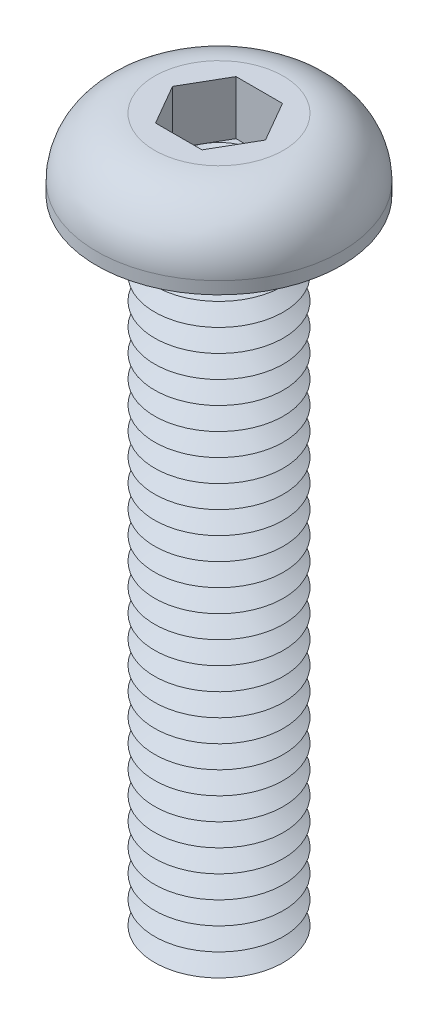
ISO-10303-21;
HEADER;
FILE_DESCRIPTION(('STEP AP214'),'2;1');
FILE_NAME('part.step','',(''),(''),'','','');
FILE_SCHEMA(('AUTOMOTIVE_DESIGN { 1 0 10303 214 1 1 1 1 }'));
ENDSEC;
DATA;
#1=APPLICATION_CONTEXT('core data for automotive mechanical design processes');
#2=APPLICATION_PROTOCOL_DEFINITION('international standard','automotive_design',2000,#1);
#3=PRODUCT_CONTEXT('',#1,'mechanical');
#4=PRODUCT('Part','Part','',(#3));
#5=PRODUCT_RELATED_PRODUCT_CATEGORY('part','',(#4));
#6=PRODUCT_DEFINITION_FORMATION('','',#4);
#7=PRODUCT_DEFINITION_CONTEXT('part definition',#1,'design');
#8=PRODUCT_DEFINITION('design','',#6,#7);
#9=PRODUCT_DEFINITION_SHAPE('','',#8);
#10=(LENGTH_UNIT() NAMED_UNIT(*) SI_UNIT(.MILLI.,.METRE.));
#11=(NAMED_UNIT(*) PLANE_ANGLE_UNIT() SI_UNIT($,.RADIAN.));
#12=(NAMED_UNIT(*) SI_UNIT($,.STERADIAN.) SOLID_ANGLE_UNIT());
#13=UNCERTAINTY_MEASURE_WITH_UNIT(LENGTH_MEASURE(1.E-05),#10,'distance_accuracy_value','');
#14=(GEOMETRIC_REPRESENTATION_CONTEXT(3) GLOBAL_UNCERTAINTY_ASSIGNED_CONTEXT((#13)) GLOBAL_UNIT_ASSIGNED_CONTEXT((#10,
#11,#12)) REPRESENTATION_CONTEXT('',''));
#15=CARTESIAN_POINT('',(0.,0.,0.));
#16=DIRECTION('',(0.,0.,1.));
#17=DIRECTION('',(1.,0.,0.));
#18=AXIS2_PLACEMENT_3D('',#15,#16,#17);
#19=CARTESIAN_POINT('',(0.,0.,0.));
#20=DIRECTION('',(0.,-1.,0.));
#21=DIRECTION('',(0.,0.,-1.));
#22=AXIS2_PLACEMENT_3D('',#19,#20,#21);
#23=TOROIDAL_SURFACE('',#22,2.35,0.35);
#24=CARTESIAN_POINT('',(0.,0.,-2.7));
#25=VERTEX_POINT('',#24);
#26=VERTEX_LOOP('',#25);
#27=FACE_BOUND('',#26,.T.);
#28=ADVANCED_FACE('P0_F12',(#27),#23,.T.);
#29=CLOSED_SHELL('',(#28));
#30=MANIFOLD_SOLID_BREP('P0_B1',#29);
#31=CARTESIAN_POINT('',(0.721687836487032,0.530000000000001,-1.25));
#32=DIRECTION('',(0.,1.,0.));
#33=DIRECTION('',(0.,0.,1.));
#34=AXIS2_PLACEMENT_3D('',#31,#32,#33);
#35=PLANE('',#34);
#36=CARTESIAN_POINT('',(0.,0.530000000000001,0.));
#37=DIRECTION('',(0.,1.,0.));
#38=DIRECTION('',(0.,0.,1.));
#39=AXIS2_PLACEMENT_3D('',#36,#37,#38);
#40=CIRCLE('',#39,1.25);
#41=CARTESIAN_POINT('',(0.,0.530000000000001,1.25));
#42=VERTEX_POINT('',#41);
#43=CARTESIAN_POINT('',(1.08253175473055,0.530000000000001,0.625));
#44=VERTEX_POINT('',#43);
#45=EDGE_CURVE('P1_E93',#42,#44,#40,.T.);
#46=ORIENTED_EDGE('',*,*,#45,.F.);
#47=DIRECTION('',(1.,0.,0.));
#48=VECTOR('',#47,1.);
#49=CARTESIAN_POINT('',(-0.721687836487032,0.530000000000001,1.25));
#50=LINE('',#49,#48);
#51=CARTESIAN_POINT('',(0.721687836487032,0.530000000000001,1.25));
#52=VERTEX_POINT('',#51);
#53=EDGE_CURVE('P1_E116',#42,#52,#50,.T.);
#54=ORIENTED_EDGE('',*,*,#53,.T.);
#55=DIRECTION('',(0.5,0.,-0.866025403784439));
#56=VECTOR('',#55,1.);
#57=CARTESIAN_POINT('',(0.721687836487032,0.530000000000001,1.25));
#58=LINE('',#57,#56);
#59=EDGE_CURVE('P1_E112',#52,#44,#58,.T.);
#60=ORIENTED_EDGE('',*,*,#59,.T.);
#61=EDGE_LOOP('',(#46,#54,#60));
#62=FACE_BOUND('',#61,.T.);
#63=ADVANCED_FACE('P1_F15',(#62),#35,.T.);
#64=CARTESIAN_POINT('',(0.,0.530000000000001,0.));
#65=DIRECTION('',(0.,1.,0.));
#66=DIRECTION('',(0.,0.,1.));
#67=AXIS2_PLACEMENT_3D('',#64,#65,#66);
#68=CIRCLE('',#67,1.25);
#69=CARTESIAN_POINT('',(1.08253175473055,0.530000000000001,-0.625));
#70=VERTEX_POINT('',#69);
#71=EDGE_CURVE('P1_E10',#44,#70,#68,.T.);
#72=ORIENTED_EDGE('',*,*,#71,.F.);
#73=CARTESIAN_POINT('',(1.44337567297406,0.530000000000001,0.));
#74=VERTEX_POINT('',#73);
#75=EDGE_CURVE('P1_E104',#44,#74,#58,.T.);
#76=ORIENTED_EDGE('',*,*,#75,.T.);
#77=DIRECTION('',(-0.5,0.,-0.866025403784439));
#78=VECTOR('',#77,1.);
#79=CARTESIAN_POINT('',(1.44337567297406,0.530000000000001,0.));
#80=LINE('',#79,#78);
#81=EDGE_CURVE('P1_E107',#74,#70,#80,.T.);
#82=ORIENTED_EDGE('',*,*,#81,.T.);
#83=EDGE_LOOP('',(#72,#76,#82));
#84=FACE_BOUND('',#83,.T.);
#85=ADVANCED_FACE('P1_F103',(#84),#35,.T.);
#86=CARTESIAN_POINT('',(0.,0.530000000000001,-1.25));
#87=VERTEX_POINT('',#86);
#88=EDGE_CURVE('P1_E24',#70,#87,#68,.T.);
#89=ORIENTED_EDGE('',*,*,#88,.F.);
#90=CARTESIAN_POINT('',(0.721687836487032,0.530000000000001,-1.25));
#91=VERTEX_POINT('',#90);
#92=EDGE_CURVE('P1_E139',#70,#91,#80,.T.);
#93=ORIENTED_EDGE('',*,*,#92,.T.);
#94=DIRECTION('',(-1.,0.,0.));
#95=VECTOR('',#94,1.);
#96=CARTESIAN_POINT('',(0.721687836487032,0.530000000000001,-1.25));
#97=LINE('',#96,#95);
#98=EDGE_CURVE('P1_E390',#91,#87,#97,.T.);
#99=ORIENTED_EDGE('',*,*,#98,.T.);
#100=EDGE_LOOP('',(#89,#93,#99));
#101=FACE_BOUND('',#100,.T.);
#102=ADVANCED_FACE('P1_F355',(#101),#35,.T.);
#103=CARTESIAN_POINT('',(-1.08253175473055,0.530000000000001,-0.625));
#104=VERTEX_POINT('',#103);
#105=EDGE_CURVE('P1_E385',#87,#104,#68,.T.);
#106=ORIENTED_EDGE('',*,*,#105,.F.);
#107=CARTESIAN_POINT('',(-0.721687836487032,0.530000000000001,-1.25));
#108=VERTEX_POINT('',#107);
#109=EDGE_CURVE('P1_E394',#87,#108,#97,.T.);
#110=ORIENTED_EDGE('',*,*,#109,.T.);
#111=DIRECTION('',(-0.5,0.,0.866025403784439));
#112=VECTOR('',#111,1.);
#113=CARTESIAN_POINT('',(-0.721687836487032,0.530000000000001,-1.25));
#114=LINE('',#113,#112);
#115=EDGE_CURVE('P1_E389',#108,#104,#114,.T.);
#116=ORIENTED_EDGE('',*,*,#115,.T.);
#117=EDGE_LOOP('',(#106,#110,#116));
#118=FACE_BOUND('',#117,.T.);
#119=ADVANCED_FACE('P1_F369',(#118),#35,.T.);
#120=CARTESIAN_POINT('',(-1.08253175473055,0.530000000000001,0.625));
#121=VERTEX_POINT('',#120);
#122=EDGE_CURVE('P1_E31',#104,#121,#68,.T.);
#123=ORIENTED_EDGE('',*,*,#122,.F.);
#124=CARTESIAN_POINT('',(-1.44337567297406,0.530000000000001,0.));
#125=VERTEX_POINT('',#124);
#126=EDGE_CURVE('P1_E381',#104,#125,#114,.T.);
#127=ORIENTED_EDGE('',*,*,#126,.T.);
#128=DIRECTION('',(0.5,0.,0.866025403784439));
#129=VECTOR('',#128,1.);
#130=CARTESIAN_POINT('',(-1.44337567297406,0.530000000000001,0.));
#131=LINE('',#130,#129);
#132=EDGE_CURVE('P1_E384',#125,#121,#131,.T.);
#133=ORIENTED_EDGE('',*,*,#132,.T.);
#134=EDGE_LOOP('',(#123,#127,#133));
#135=FACE_BOUND('',#134,.T.);
#136=ADVANCED_FACE('P1_F360',(#135),#35,.T.);
#137=CARTESIAN_POINT('',(0.,-19.3,0.));
#138=DIRECTION('',(0.,1.,0.));
#139=DIRECTION('',(0.,0.,1.));
#140=AXIS2_PLACEMENT_3D('',#137,#138,#139);
#141=CONICAL_SURFACE('',#140,1.39378221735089,1.0471975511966);
#142=CARTESIAN_POINT('',(0.,-18.95,0.));
#143=DIRECTION('',(0.,-1.,0.));
#144=DIRECTION('',(0.,0.,-1.));
#145=AXIS2_PLACEMENT_3D('',#142,#143,#144);
#146=CIRCLE('',#145,2.);
#147=CARTESIAN_POINT('',(0.,-18.95,-2.));
#148=VERTEX_POINT('',#147);
#149=EDGE_CURVE('P1_E317',#148,#148,#146,.T.);
#150=ORIENTED_EDGE('',*,*,#149,.T.);
#151=EDGE_LOOP('',(#150));
#152=FACE_BOUND('',#151,.T.);
#153=CARTESIAN_POINT('',(0.,-19.3,0.));
#154=DIRECTION('',(0.,-1.,0.));
#155=DIRECTION('',(0.,0.,-1.));
#156=AXIS2_PLACEMENT_3D('',#153,#154,#155);
#157=CIRCLE('',#156,1.39378221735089);
#158=CARTESIAN_POINT('',(0.,-19.3,-1.39378221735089));
#159=VERTEX_POINT('',#158);
#160=EDGE_CURVE('P1_E320',#159,#159,#157,.T.);
#161=ORIENTED_EDGE('',*,*,#160,.F.);
#162=EDGE_LOOP('',(#161));
#163=FACE_BOUND('',#162,.T.);
#164=ADVANCED_FACE('P1_F368',(#152,#163),#141,.T.);
#165=CARTESIAN_POINT('',(0.,-19.65,0.));
#166=DIRECTION('',(0.,-1.,0.));
#167=DIRECTION('',(0.,0.,-1.));
#168=AXIS2_PLACEMENT_3D('',#165,#166,#167);
#169=CONICAL_SURFACE('',#168,2.,1.0471975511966);
#170=ORIENTED_EDGE('',*,*,#160,.T.);
#171=EDGE_LOOP('',(#170));
#172=FACE_BOUND('',#171,.T.);
#173=CARTESIAN_POINT('',(0.,-19.65,0.));
#174=DIRECTION('',(0.,-1.,0.));
#175=DIRECTION('',(0.,0.,-1.));
#176=AXIS2_PLACEMENT_3D('',#173,#174,#175);
#177=CIRCLE('',#176,2.);
#178=CARTESIAN_POINT('',(0.,-19.65,-2.));
#179=VERTEX_POINT('',#178);
#180=EDGE_CURVE('P1_E323',#179,#179,#177,.T.);
#181=ORIENTED_EDGE('',*,*,#180,.F.);
#182=EDGE_LOOP('',(#181));
#183=FACE_BOUND('',#182,.T.);
#184=ADVANCED_FACE('P1_F375',(#172,#183),#169,.T.);
#185=CARTESIAN_POINT('',(0.,-20.,0.));
#186=DIRECTION('',(0.,1.,0.));
#187=DIRECTION('',(0.,0.,1.));
#188=AXIS2_PLACEMENT_3D('',#185,#186,#187);
#189=PLANE('',#188);
#190=CARTESIAN_POINT('',(0.,-20.,0.));
#191=DIRECTION('',(0.,-1.,0.));
#192=DIRECTION('',(0.,0.,-1.));
#193=AXIS2_PLACEMENT_3D('',#190,#191,#192);
#194=CIRCLE('',#193,1.39378221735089);
#195=CARTESIAN_POINT('',(0.,-20.,-1.39378221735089));
#196=VERTEX_POINT('',#195);
#197=EDGE_CURVE('P1_E326',#196,#196,#194,.T.);
#198=ORIENTED_EDGE('',*,*,#197,.T.);
#199=EDGE_LOOP('',(#198));
#200=FACE_BOUND('',#199,.T.);
#201=ADVANCED_FACE('P1_F453',(#200),#189,.F.);
#202=CARTESIAN_POINT('',(0.,-20.,0.));
#203=DIRECTION('',(0.,1.,0.));
#204=DIRECTION('',(0.,0.,1.));
#205=AXIS2_PLACEMENT_3D('',#202,#203,#204);
#206=CONICAL_SURFACE('',#205,1.39378221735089,1.0471975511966);
#207=ORIENTED_EDGE('',*,*,#180,.T.);
#208=EDGE_LOOP('',(#207));
#209=FACE_BOUND('',#208,.T.);
#210=ORIENTED_EDGE('',*,*,#197,.F.);
#211=EDGE_LOOP('',(#210));
#212=FACE_BOUND('',#211,.T.);
#213=ADVANCED_FACE('P1_F464',(#209,#212),#206,.T.);
#214=CARTESIAN_POINT('',(0.,-18.6,0.));
#215=DIRECTION('',(0.,1.,0.));
#216=DIRECTION('',(0.,0.,1.));
#217=AXIS2_PLACEMENT_3D('',#214,#215,#216);
#218=CONICAL_SURFACE('',#217,1.39378221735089,1.0471975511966);
#219=CARTESIAN_POINT('',(0.,-18.25,0.));
#220=DIRECTION('',(0.,-1.,0.));
#221=DIRECTION('',(0.,0.,-1.));
#222=AXIS2_PLACEMENT_3D('',#219,#220,#221);
#223=CIRCLE('',#222,2.);
#224=CARTESIAN_POINT('',(0.,-18.25,-2.));
#225=VERTEX_POINT('',#224);
#226=EDGE_CURVE('P1_E311',#225,#225,#223,.T.);
#227=ORIENTED_EDGE('',*,*,#226,.T.);
#228=EDGE_LOOP('',(#227));
#229=FACE_BOUND('',#228,.T.);
#230=CARTESIAN_POINT('',(0.,-18.6,0.));
#231=DIRECTION('',(0.,-1.,0.));
#232=DIRECTION('',(0.,0.,-1.));
#233=AXIS2_PLACEMENT_3D('',#230,#231,#232);
#234=CIRCLE('',#233,1.39378221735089);
#235=CARTESIAN_POINT('',(0.,-18.6,-1.39378221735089));
#236=VERTEX_POINT('',#235);
#237=EDGE_CURVE('P1_E314',#236,#236,#234,.T.);
#238=ORIENTED_EDGE('',*,*,#237,.F.);
#239=EDGE_LOOP('',(#238));
#240=FACE_BOUND('',#239,.T.);
#241=ADVANCED_FACE('P1_F473',(#229,#240),#218,.T.);
#242=CARTESIAN_POINT('',(0.,-18.95,0.));
#243=DIRECTION('',(0.,-1.,0.));
#244=DIRECTION('',(0.,0.,-1.));
#245=AXIS2_PLACEMENT_3D('',#242,#243,#244);
#246=CONICAL_SURFACE('',#245,2.,1.0471975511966);
#247=ORIENTED_EDGE('',*,*,#237,.T.);
#248=EDGE_LOOP('',(#247));
#249=FACE_BOUND('',#248,.T.);
#250=ORIENTED_EDGE('',*,*,#149,.F.);
#251=EDGE_LOOP('',(#250));
#252=FACE_BOUND('',#251,.T.);
#253=ADVANCED_FACE('P1_F482',(#249,#252),#246,.T.);
#254=CARTESIAN_POINT('',(0.,-17.9,0.));
#255=DIRECTION('',(0.,1.,0.));
#256=DIRECTION('',(0.,0.,1.));
#257=AXIS2_PLACEMENT_3D('',#254,#255,#256);
#258=CONICAL_SURFACE('',#257,1.39378221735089,1.0471975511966);
#259=CARTESIAN_POINT('',(0.,-17.55,0.));
#260=DIRECTION('',(0.,-1.,0.));
#261=DIRECTION('',(0.,0.,-1.));
#262=AXIS2_PLACEMENT_3D('',#259,#260,#261);
#263=CIRCLE('',#262,2.);
#264=CARTESIAN_POINT('',(0.,-17.55,-2.));
#265=VERTEX_POINT('',#264);
#266=EDGE_CURVE('P1_E305',#265,#265,#263,.T.);
#267=ORIENTED_EDGE('',*,*,#266,.T.);
#268=EDGE_LOOP('',(#267));
#269=FACE_BOUND('',#268,.T.);
#270=CARTESIAN_POINT('',(0.,-17.9,0.));
#271=DIRECTION('',(0.,-1.,0.));
#272=DIRECTION('',(0.,0.,-1.));
#273=AXIS2_PLACEMENT_3D('',#270,#271,#272);
#274=CIRCLE('',#273,1.39378221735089);
#275=CARTESIAN_POINT('',(0.,-17.9,-1.39378221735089));
#276=VERTEX_POINT('',#275);
#277=EDGE_CURVE('P1_E308',#276,#276,#274,.T.);
#278=ORIENTED_EDGE('',*,*,#277,.F.);
#279=EDGE_LOOP('',(#278));
#280=FACE_BOUND('',#279,.T.);
#281=ADVANCED_FACE('P1_F492',(#269,#280),#258,.T.);
#282=CARTESIAN_POINT('',(0.,-18.25,0.));
#283=DIRECTION('',(0.,-1.,0.));
#284=DIRECTION('',(0.,0.,-1.));
#285=AXIS2_PLACEMENT_3D('',#282,#283,#284);
#286=CONICAL_SURFACE('',#285,2.,1.0471975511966);
#287=ORIENTED_EDGE('',*,*,#277,.T.);
#288=EDGE_LOOP('',(#287));
#289=FACE_BOUND('',#288,.T.);
#290=ORIENTED_EDGE('',*,*,#226,.F.);
#291=EDGE_LOOP('',(#290));
#292=FACE_BOUND('',#291,.T.);
#293=ADVANCED_FACE('P1_F502',(#289,#292),#286,.T.);
#294=CARTESIAN_POINT('',(0.,-17.2,0.));
#295=DIRECTION('',(0.,1.,0.));
#296=DIRECTION('',(0.,0.,1.));
#297=AXIS2_PLACEMENT_3D('',#294,#295,#296);
#298=CONICAL_SURFACE('',#297,1.39378221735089,1.0471975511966);
#299=CARTESIAN_POINT('',(0.,-16.85,0.));
#300=DIRECTION('',(0.,-1.,0.));
#301=DIRECTION('',(0.,0.,-1.));
#302=AXIS2_PLACEMENT_3D('',#299,#300,#301);
#303=CIRCLE('',#302,2.);
#304=CARTESIAN_POINT('',(0.,-16.85,-2.));
#305=VERTEX_POINT('',#304);
#306=EDGE_CURVE('P1_E299',#305,#305,#303,.T.);
#307=ORIENTED_EDGE('',*,*,#306,.T.);
#308=EDGE_LOOP('',(#307));
#309=FACE_BOUND('',#308,.T.);
#310=CARTESIAN_POINT('',(0.,-17.2,0.));
#311=DIRECTION('',(0.,-1.,0.));
#312=DIRECTION('',(0.,0.,-1.));
#313=AXIS2_PLACEMENT_3D('',#310,#311,#312);
#314=CIRCLE('',#313,1.39378221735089);
#315=CARTESIAN_POINT('',(0.,-17.2,-1.39378221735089));
#316=VERTEX_POINT('',#315);
#317=EDGE_CURVE('P1_E302',#316,#316,#314,.T.);
#318=ORIENTED_EDGE('',*,*,#317,.F.);
#319=EDGE_LOOP('',(#318));
#320=FACE_BOUND('',#319,.T.);
#321=ADVANCED_FACE('P1_F512',(#309,#320),#298,.T.);
#322=CARTESIAN_POINT('',(0.,-17.55,0.));
#323=DIRECTION('',(0.,-1.,0.));
#324=DIRECTION('',(0.,0.,-1.));
#325=AXIS2_PLACEMENT_3D('',#322,#323,#324);
#326=CONICAL_SURFACE('',#325,2.,1.0471975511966);
#327=ORIENTED_EDGE('',*,*,#317,.T.);
#328=EDGE_LOOP('',(#327));
#329=FACE_BOUND('',#328,.T.);
#330=ORIENTED_EDGE('',*,*,#266,.F.);
#331=EDGE_LOOP('',(#330));
#332=FACE_BOUND('',#331,.T.);
#333=ADVANCED_FACE('P1_F522',(#329,#332),#326,.T.);
#334=CARTESIAN_POINT('',(0.,-16.5,0.));
#335=DIRECTION('',(0.,1.,0.));
#336=DIRECTION('',(0.,0.,1.));
#337=AXIS2_PLACEMENT_3D('',#334,#335,#336);
#338=CONICAL_SURFACE('',#337,1.39378221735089,1.0471975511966);
#339=CARTESIAN_POINT('',(0.,-16.15,0.));
#340=DIRECTION('',(0.,-1.,0.));
#341=DIRECTION('',(0.,0.,-1.));
#342=AXIS2_PLACEMENT_3D('',#339,#340,#341);
#343=CIRCLE('',#342,2.);
#344=CARTESIAN_POINT('',(0.,-16.15,-2.));
#345=VERTEX_POINT('',#344);
#346=EDGE_CURVE('P1_E293',#345,#345,#343,.T.);
#347=ORIENTED_EDGE('',*,*,#346,.T.);
#348=EDGE_LOOP('',(#347));
#349=FACE_BOUND('',#348,.T.);
#350=CARTESIAN_POINT('',(0.,-16.5,0.));
#351=DIRECTION('',(0.,-1.,0.));
#352=DIRECTION('',(0.,0.,-1.));
#353=AXIS2_PLACEMENT_3D('',#350,#351,#352);
#354=CIRCLE('',#353,1.39378221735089);
#355=CARTESIAN_POINT('',(0.,-16.5,-1.39378221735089));
#356=VERTEX_POINT('',#355);
#357=EDGE_CURVE('P1_E296',#356,#356,#354,.T.);
#358=ORIENTED_EDGE('',*,*,#357,.F.);
#359=EDGE_LOOP('',(#358));
#360=FACE_BOUND('',#359,.T.);
#361=ADVANCED_FACE('P1_F532',(#349,#360),#338,.T.);
#362=CARTESIAN_POINT('',(0.,-16.85,0.));
#363=DIRECTION('',(0.,-1.,0.));
#364=DIRECTION('',(0.,0.,-1.));
#365=AXIS2_PLACEMENT_3D('',#362,#363,#364);
#366=CONICAL_SURFACE('',#365,2.,1.0471975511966);
#367=ORIENTED_EDGE('',*,*,#357,.T.);
#368=EDGE_LOOP('',(#367));
#369=FACE_BOUND('',#368,.T.);
#370=ORIENTED_EDGE('',*,*,#306,.F.);
#371=EDGE_LOOP('',(#370));
#372=FACE_BOUND('',#371,.T.);
#373=ADVANCED_FACE('P1_F542',(#369,#372),#366,.T.);
#374=CARTESIAN_POINT('',(0.,-15.8,0.));
#375=DIRECTION('',(0.,1.,0.));
#376=DIRECTION('',(0.,0.,1.));
#377=AXIS2_PLACEMENT_3D('',#374,#375,#376);
#378=CONICAL_SURFACE('',#377,1.39378221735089,1.0471975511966);
#379=CARTESIAN_POINT('',(0.,-15.45,0.));
#380=DIRECTION('',(0.,-1.,0.));
#381=DIRECTION('',(0.,0.,-1.));
#382=AXIS2_PLACEMENT_3D('',#379,#380,#381);
#383=CIRCLE('',#382,2.);
#384=CARTESIAN_POINT('',(0.,-15.45,-2.));
#385=VERTEX_POINT('',#384);
#386=EDGE_CURVE('P1_E287',#385,#385,#383,.T.);
#387=ORIENTED_EDGE('',*,*,#386,.T.);
#388=EDGE_LOOP('',(#387));
#389=FACE_BOUND('',#388,.T.);
#390=CARTESIAN_POINT('',(0.,-15.8,0.));
#391=DIRECTION('',(0.,-1.,0.));
#392=DIRECTION('',(0.,0.,-1.));
#393=AXIS2_PLACEMENT_3D('',#390,#391,#392);
#394=CIRCLE('',#393,1.39378221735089);
#395=CARTESIAN_POINT('',(0.,-15.8,-1.39378221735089));
#396=VERTEX_POINT('',#395);
#397=EDGE_CURVE('P1_E290',#396,#396,#394,.T.);
#398=ORIENTED_EDGE('',*,*,#397,.F.);
#399=EDGE_LOOP('',(#398));
#400=FACE_BOUND('',#399,.T.);
#401=ADVANCED_FACE('P1_F552',(#389,#400),#378,.T.);
#402=CARTESIAN_POINT('',(0.,-16.15,0.));
#403=DIRECTION('',(0.,-1.,0.));
#404=DIRECTION('',(0.,0.,-1.));
#405=AXIS2_PLACEMENT_3D('',#402,#403,#404);
#406=CONICAL_SURFACE('',#405,2.,1.0471975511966);
#407=ORIENTED_EDGE('',*,*,#397,.T.);
#408=EDGE_LOOP('',(#407));
#409=FACE_BOUND('',#408,.T.);
#410=ORIENTED_EDGE('',*,*,#346,.F.);
#411=EDGE_LOOP('',(#410));
#412=FACE_BOUND('',#411,.T.);
#413=ADVANCED_FACE('P1_F562',(#409,#412),#406,.T.);
#414=CARTESIAN_POINT('',(0.,-15.1,0.));
#415=DIRECTION('',(0.,1.,0.));
#416=DIRECTION('',(0.,0.,1.));
#417=AXIS2_PLACEMENT_3D('',#414,#415,#416);
#418=CONICAL_SURFACE('',#417,1.39378221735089,1.0471975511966);
#419=CARTESIAN_POINT('',(0.,-14.75,0.));
#420=DIRECTION('',(0.,-1.,0.));
#421=DIRECTION('',(0.,0.,-1.));
#422=AXIS2_PLACEMENT_3D('',#419,#420,#421);
#423=CIRCLE('',#422,2.);
#424=CARTESIAN_POINT('',(0.,-14.75,-2.));
#425=VERTEX_POINT('',#424);
#426=EDGE_CURVE('P1_E281',#425,#425,#423,.T.);
#427=ORIENTED_EDGE('',*,*,#426,.T.);
#428=EDGE_LOOP('',(#427));
#429=FACE_BOUND('',#428,.T.);
#430=CARTESIAN_POINT('',(0.,-15.1,0.));
#431=DIRECTION('',(0.,-1.,0.));
#432=DIRECTION('',(0.,0.,-1.));
#433=AXIS2_PLACEMENT_3D('',#430,#431,#432);
#434=CIRCLE('',#433,1.39378221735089);
#435=CARTESIAN_POINT('',(0.,-15.1,-1.39378221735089));
#436=VERTEX_POINT('',#435);
#437=EDGE_CURVE('P1_E284',#436,#436,#434,.T.);
#438=ORIENTED_EDGE('',*,*,#437,.F.);
#439=EDGE_LOOP('',(#438));
#440=FACE_BOUND('',#439,.T.);
#441=ADVANCED_FACE('P1_F572',(#429,#440),#418,.T.);
#442=CARTESIAN_POINT('',(0.,-15.45,0.));
#443=DIRECTION('',(0.,-1.,0.));
#444=DIRECTION('',(0.,0.,-1.));
#445=AXIS2_PLACEMENT_3D('',#442,#443,#444);
#446=CONICAL_SURFACE('',#445,2.,1.0471975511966);
#447=ORIENTED_EDGE('',*,*,#437,.T.);
#448=EDGE_LOOP('',(#447));
#449=FACE_BOUND('',#448,.T.);
#450=ORIENTED_EDGE('',*,*,#386,.F.);
#451=EDGE_LOOP('',(#450));
#452=FACE_BOUND('',#451,.T.);
#453=ADVANCED_FACE('P1_F582',(#449,#452),#446,.T.);
#454=CARTESIAN_POINT('',(0.,-14.4,0.));
#455=DIRECTION('',(0.,1.,0.));
#456=DIRECTION('',(0.,0.,1.));
#457=AXIS2_PLACEMENT_3D('',#454,#455,#456);
#458=CONICAL_SURFACE('',#457,1.39378221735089,1.0471975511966);
#459=CARTESIAN_POINT('',(0.,-14.05,0.));
#460=DIRECTION('',(0.,-1.,0.));
#461=DIRECTION('',(0.,0.,-1.));
#462=AXIS2_PLACEMENT_3D('',#459,#460,#461);
#463=CIRCLE('',#462,2.);
#464=CARTESIAN_POINT('',(0.,-14.05,-2.));
#465=VERTEX_POINT('',#464);
#466=EDGE_CURVE('P1_E275',#465,#465,#463,.T.);
#467=ORIENTED_EDGE('',*,*,#466,.T.);
#468=EDGE_LOOP('',(#467));
#469=FACE_BOUND('',#468,.T.);
#470=CARTESIAN_POINT('',(0.,-14.4,0.));
#471=DIRECTION('',(0.,-1.,0.));
#472=DIRECTION('',(0.,0.,-1.));
#473=AXIS2_PLACEMENT_3D('',#470,#471,#472);
#474=CIRCLE('',#473,1.39378221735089);
#475=CARTESIAN_POINT('',(0.,-14.4,-1.39378221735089));
#476=VERTEX_POINT('',#475);
#477=EDGE_CURVE('P1_E278',#476,#476,#474,.T.);
#478=ORIENTED_EDGE('',*,*,#477,.F.);
#479=EDGE_LOOP('',(#478));
#480=FACE_BOUND('',#479,.T.);
#481=ADVANCED_FACE('P1_F592',(#469,#480),#458,.T.);
#482=CARTESIAN_POINT('',(0.,-14.75,0.));
#483=DIRECTION('',(0.,-1.,0.));
#484=DIRECTION('',(0.,0.,-1.));
#485=AXIS2_PLACEMENT_3D('',#482,#483,#484);
#486=CONICAL_SURFACE('',#485,2.,1.0471975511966);
#487=ORIENTED_EDGE('',*,*,#477,.T.);
#488=EDGE_LOOP('',(#487));
#489=FACE_BOUND('',#488,.T.);
#490=ORIENTED_EDGE('',*,*,#426,.F.);
#491=EDGE_LOOP('',(#490));
#492=FACE_BOUND('',#491,.T.);
#493=ADVANCED_FACE('P1_F602',(#489,#492),#486,.T.);
#494=CARTESIAN_POINT('',(0.,-13.7,0.));
#495=DIRECTION('',(0.,1.,0.));
#496=DIRECTION('',(0.,0.,1.));
#497=AXIS2_PLACEMENT_3D('',#494,#495,#496);
#498=CONICAL_SURFACE('',#497,1.39378221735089,1.0471975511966);
#499=CARTESIAN_POINT('',(0.,-13.35,0.));
#500=DIRECTION('',(0.,-1.,0.));
#501=DIRECTION('',(0.,0.,-1.));
#502=AXIS2_PLACEMENT_3D('',#499,#500,#501);
#503=CIRCLE('',#502,2.);
#504=CARTESIAN_POINT('',(0.,-13.35,-2.));
#505=VERTEX_POINT('',#504);
#506=EDGE_CURVE('P1_E269',#505,#505,#503,.T.);
#507=ORIENTED_EDGE('',*,*,#506,.T.);
#508=EDGE_LOOP('',(#507));
#509=FACE_BOUND('',#508,.T.);
#510=CARTESIAN_POINT('',(0.,-13.7,0.));
#511=DIRECTION('',(0.,-1.,0.));
#512=DIRECTION('',(0.,0.,-1.));
#513=AXIS2_PLACEMENT_3D('',#510,#511,#512);
#514=CIRCLE('',#513,1.39378221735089);
#515=CARTESIAN_POINT('',(0.,-13.7,-1.39378221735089));
#516=VERTEX_POINT('',#515);
#517=EDGE_CURVE('P1_E272',#516,#516,#514,.T.);
#518=ORIENTED_EDGE('',*,*,#517,.F.);
#519=EDGE_LOOP('',(#518));
#520=FACE_BOUND('',#519,.T.);
#521=ADVANCED_FACE('P1_F612',(#509,#520),#498,.T.);
#522=CARTESIAN_POINT('',(0.,-14.05,0.));
#523=DIRECTION('',(0.,-1.,0.));
#524=DIRECTION('',(0.,0.,-1.));
#525=AXIS2_PLACEMENT_3D('',#522,#523,#524);
#526=CONICAL_SURFACE('',#525,2.,1.0471975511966);
#527=ORIENTED_EDGE('',*,*,#517,.T.);
#528=EDGE_LOOP('',(#527));
#529=FACE_BOUND('',#528,.T.);
#530=ORIENTED_EDGE('',*,*,#466,.F.);
#531=EDGE_LOOP('',(#530));
#532=FACE_BOUND('',#531,.T.);
#533=ADVANCED_FACE('P1_F622',(#529,#532),#526,.T.);
#534=CARTESIAN_POINT('',(0.,-13.,0.));
#535=DIRECTION('',(0.,1.,0.));
#536=DIRECTION('',(0.,0.,1.));
#537=AXIS2_PLACEMENT_3D('',#534,#535,#536);
#538=CONICAL_SURFACE('',#537,1.39378221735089,1.0471975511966);
#539=CARTESIAN_POINT('',(0.,-12.65,0.));
#540=DIRECTION('',(0.,-1.,0.));
#541=DIRECTION('',(0.,0.,-1.));
#542=AXIS2_PLACEMENT_3D('',#539,#540,#541);
#543=CIRCLE('',#542,2.);
#544=CARTESIAN_POINT('',(0.,-12.65,-2.));
#545=VERTEX_POINT('',#544);
#546=EDGE_CURVE('P1_E263',#545,#545,#543,.T.);
#547=ORIENTED_EDGE('',*,*,#546,.T.);
#548=EDGE_LOOP('',(#547));
#549=FACE_BOUND('',#548,.T.);
#550=CARTESIAN_POINT('',(0.,-13.,0.));
#551=DIRECTION('',(0.,-1.,0.));
#552=DIRECTION('',(0.,0.,-1.));
#553=AXIS2_PLACEMENT_3D('',#550,#551,#552);
#554=CIRCLE('',#553,1.39378221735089);
#555=CARTESIAN_POINT('',(0.,-13.,-1.39378221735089));
#556=VERTEX_POINT('',#555);
#557=EDGE_CURVE('P1_E266',#556,#556,#554,.T.);
#558=ORIENTED_EDGE('',*,*,#557,.F.);
#559=EDGE_LOOP('',(#558));
#560=FACE_BOUND('',#559,.T.);
#561=ADVANCED_FACE('P1_F632',(#549,#560),#538,.T.);
#562=CARTESIAN_POINT('',(0.,-13.35,0.));
#563=DIRECTION('',(0.,-1.,0.));
#564=DIRECTION('',(0.,0.,-1.));
#565=AXIS2_PLACEMENT_3D('',#562,#563,#564);
#566=CONICAL_SURFACE('',#565,2.,1.0471975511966);
#567=ORIENTED_EDGE('',*,*,#557,.T.);
#568=EDGE_LOOP('',(#567));
#569=FACE_BOUND('',#568,.T.);
#570=ORIENTED_EDGE('',*,*,#506,.F.);
#571=EDGE_LOOP('',(#570));
#572=FACE_BOUND('',#571,.T.);
#573=ADVANCED_FACE('P1_F642',(#569,#572),#566,.T.);
#574=CARTESIAN_POINT('',(0.,-12.3,0.));
#575=DIRECTION('',(0.,1.,0.));
#576=DIRECTION('',(0.,0.,1.));
#577=AXIS2_PLACEMENT_3D('',#574,#575,#576);
#578=CONICAL_SURFACE('',#577,1.39378221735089,1.0471975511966);
#579=CARTESIAN_POINT('',(0.,-11.95,0.));
#580=DIRECTION('',(0.,-1.,0.));
#581=DIRECTION('',(0.,0.,-1.));
#582=AXIS2_PLACEMENT_3D('',#579,#580,#581);
#583=CIRCLE('',#582,2.);
#584=CARTESIAN_POINT('',(0.,-11.95,-2.));
#585=VERTEX_POINT('',#584);
#586=EDGE_CURVE('P1_E257',#585,#585,#583,.T.);
#587=ORIENTED_EDGE('',*,*,#586,.T.);
#588=EDGE_LOOP('',(#587));
#589=FACE_BOUND('',#588,.T.);
#590=CARTESIAN_POINT('',(0.,-12.3,0.));
#591=DIRECTION('',(0.,-1.,0.));
#592=DIRECTION('',(0.,0.,-1.));
#593=AXIS2_PLACEMENT_3D('',#590,#591,#592);
#594=CIRCLE('',#593,1.39378221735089);
#595=CARTESIAN_POINT('',(0.,-12.3,-1.39378221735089));
#596=VERTEX_POINT('',#595);
#597=EDGE_CURVE('P1_E260',#596,#596,#594,.T.);
#598=ORIENTED_EDGE('',*,*,#597,.F.);
#599=EDGE_LOOP('',(#598));
#600=FACE_BOUND('',#599,.T.);
#601=ADVANCED_FACE('P1_F652',(#589,#600),#578,.T.);
#602=CARTESIAN_POINT('',(0.,-12.65,0.));
#603=DIRECTION('',(0.,-1.,0.));
#604=DIRECTION('',(0.,0.,-1.));
#605=AXIS2_PLACEMENT_3D('',#602,#603,#604);
#606=CONICAL_SURFACE('',#605,2.,1.0471975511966);
#607=ORIENTED_EDGE('',*,*,#597,.T.);
#608=EDGE_LOOP('',(#607));
#609=FACE_BOUND('',#608,.T.);
#610=ORIENTED_EDGE('',*,*,#546,.F.);
#611=EDGE_LOOP('',(#610));
#612=FACE_BOUND('',#611,.T.);
#613=ADVANCED_FACE('P1_F662',(#609,#612),#606,.T.);
#614=CARTESIAN_POINT('',(0.,-11.6,0.));
#615=DIRECTION('',(0.,1.,0.));
#616=DIRECTION('',(0.,0.,1.));
#617=AXIS2_PLACEMENT_3D('',#614,#615,#616);
#618=CONICAL_SURFACE('',#617,1.39378221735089,1.0471975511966);
#619=CARTESIAN_POINT('',(0.,-11.25,0.));
#620=DIRECTION('',(0.,-1.,0.));
#621=DIRECTION('',(0.,0.,-1.));
#622=AXIS2_PLACEMENT_3D('',#619,#620,#621);
#623=CIRCLE('',#622,2.);
#624=CARTESIAN_POINT('',(0.,-11.25,-2.));
#625=VERTEX_POINT('',#624);
#626=EDGE_CURVE('P1_E251',#625,#625,#623,.T.);
#627=ORIENTED_EDGE('',*,*,#626,.T.);
#628=EDGE_LOOP('',(#627));
#629=FACE_BOUND('',#628,.T.);
#630=CARTESIAN_POINT('',(0.,-11.6,0.));
#631=DIRECTION('',(0.,-1.,0.));
#632=DIRECTION('',(0.,0.,-1.));
#633=AXIS2_PLACEMENT_3D('',#630,#631,#632);
#634=CIRCLE('',#633,1.39378221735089);
#635=CARTESIAN_POINT('',(0.,-11.6,-1.39378221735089));
#636=VERTEX_POINT('',#635);
#637=EDGE_CURVE('P1_E254',#636,#636,#634,.T.);
#638=ORIENTED_EDGE('',*,*,#637,.F.);
#639=EDGE_LOOP('',(#638));
#640=FACE_BOUND('',#639,.T.);
#641=ADVANCED_FACE('P1_F672',(#629,#640),#618,.T.);
#642=CARTESIAN_POINT('',(0.,-11.95,0.));
#643=DIRECTION('',(0.,-1.,0.));
#644=DIRECTION('',(0.,0.,-1.));
#645=AXIS2_PLACEMENT_3D('',#642,#643,#644);
#646=CONICAL_SURFACE('',#645,2.,1.0471975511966);
#647=ORIENTED_EDGE('',*,*,#637,.T.);
#648=EDGE_LOOP('',(#647));
#649=FACE_BOUND('',#648,.T.);
#650=ORIENTED_EDGE('',*,*,#586,.F.);
#651=EDGE_LOOP('',(#650));
#652=FACE_BOUND('',#651,.T.);
#653=ADVANCED_FACE('P1_F682',(#649,#652),#646,.T.);
#654=CARTESIAN_POINT('',(0.,-10.9,0.));
#655=DIRECTION('',(0.,1.,0.));
#656=DIRECTION('',(0.,0.,1.));
#657=AXIS2_PLACEMENT_3D('',#654,#655,#656);
#658=CONICAL_SURFACE('',#657,1.39378221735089,1.0471975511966);
#659=CARTESIAN_POINT('',(0.,-10.55,0.));
#660=DIRECTION('',(0.,-1.,0.));
#661=DIRECTION('',(0.,0.,-1.));
#662=AXIS2_PLACEMENT_3D('',#659,#660,#661);
#663=CIRCLE('',#662,2.);
#664=CARTESIAN_POINT('',(0.,-10.55,-2.));
#665=VERTEX_POINT('',#664);
#666=EDGE_CURVE('P1_E245',#665,#665,#663,.T.);
#667=ORIENTED_EDGE('',*,*,#666,.T.);
#668=EDGE_LOOP('',(#667));
#669=FACE_BOUND('',#668,.T.);
#670=CARTESIAN_POINT('',(0.,-10.9,0.));
#671=DIRECTION('',(0.,-1.,0.));
#672=DIRECTION('',(0.,0.,-1.));
#673=AXIS2_PLACEMENT_3D('',#670,#671,#672);
#674=CIRCLE('',#673,1.39378221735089);
#675=CARTESIAN_POINT('',(0.,-10.9,-1.39378221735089));
#676=VERTEX_POINT('',#675);
#677=EDGE_CURVE('P1_E248',#676,#676,#674,.T.);
#678=ORIENTED_EDGE('',*,*,#677,.F.);
#679=EDGE_LOOP('',(#678));
#680=FACE_BOUND('',#679,.T.);
#681=ADVANCED_FACE('P1_F692',(#669,#680),#658,.T.);
#682=CARTESIAN_POINT('',(0.,-11.25,0.));
#683=DIRECTION('',(0.,-1.,0.));
#684=DIRECTION('',(0.,0.,-1.));
#685=AXIS2_PLACEMENT_3D('',#682,#683,#684);
#686=CONICAL_SURFACE('',#685,2.,1.0471975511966);
#687=ORIENTED_EDGE('',*,*,#677,.T.);
#688=EDGE_LOOP('',(#687));
#689=FACE_BOUND('',#688,.T.);
#690=ORIENTED_EDGE('',*,*,#626,.F.);
#691=EDGE_LOOP('',(#690));
#692=FACE_BOUND('',#691,.T.);
#693=ADVANCED_FACE('P1_F702',(#689,#692),#686,.T.);
#694=CARTESIAN_POINT('',(0.,-10.2,0.));
#695=DIRECTION('',(0.,1.,0.));
#696=DIRECTION('',(0.,0.,1.));
#697=AXIS2_PLACEMENT_3D('',#694,#695,#696);
#698=CONICAL_SURFACE('',#697,1.39378221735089,1.0471975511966);
#699=CARTESIAN_POINT('',(0.,-9.85,0.));
#700=DIRECTION('',(0.,-1.,0.));
#701=DIRECTION('',(0.,0.,-1.));
#702=AXIS2_PLACEMENT_3D('',#699,#700,#701);
#703=CIRCLE('',#702,2.);
#704=CARTESIAN_POINT('',(0.,-9.85,-2.));
#705=VERTEX_POINT('',#704);
#706=EDGE_CURVE('P1_E239',#705,#705,#703,.T.);
#707=ORIENTED_EDGE('',*,*,#706,.T.);
#708=EDGE_LOOP('',(#707));
#709=FACE_BOUND('',#708,.T.);
#710=CARTESIAN_POINT('',(0.,-10.2,0.));
#711=DIRECTION('',(0.,-1.,0.));
#712=DIRECTION('',(0.,0.,-1.));
#713=AXIS2_PLACEMENT_3D('',#710,#711,#712);
#714=CIRCLE('',#713,1.39378221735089);
#715=CARTESIAN_POINT('',(0.,-10.2,-1.39378221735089));
#716=VERTEX_POINT('',#715);
#717=EDGE_CURVE('P1_E242',#716,#716,#714,.T.);
#718=ORIENTED_EDGE('',*,*,#717,.F.);
#719=EDGE_LOOP('',(#718));
#720=FACE_BOUND('',#719,.T.);
#721=ADVANCED_FACE('P1_F712',(#709,#720),#698,.T.);
#722=CARTESIAN_POINT('',(0.,-10.55,0.));
#723=DIRECTION('',(0.,-1.,0.));
#724=DIRECTION('',(0.,0.,-1.));
#725=AXIS2_PLACEMENT_3D('',#722,#723,#724);
#726=CONICAL_SURFACE('',#725,2.,1.0471975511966);
#727=ORIENTED_EDGE('',*,*,#717,.T.);
#728=EDGE_LOOP('',(#727));
#729=FACE_BOUND('',#728,.T.);
#730=ORIENTED_EDGE('',*,*,#666,.F.);
#731=EDGE_LOOP('',(#730));
#732=FACE_BOUND('',#731,.T.);
#733=ADVANCED_FACE('P1_F722',(#729,#732),#726,.T.);
#734=CARTESIAN_POINT('',(0.,-9.5,0.));
#735=DIRECTION('',(0.,1.,0.));
#736=DIRECTION('',(0.,0.,1.));
#737=AXIS2_PLACEMENT_3D('',#734,#735,#736);
#738=CONICAL_SURFACE('',#737,1.39378221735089,1.0471975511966);
#739=CARTESIAN_POINT('',(0.,-9.15,0.));
#740=DIRECTION('',(0.,-1.,0.));
#741=DIRECTION('',(0.,0.,-1.));
#742=AXIS2_PLACEMENT_3D('',#739,#740,#741);
#743=CIRCLE('',#742,2.);
#744=CARTESIAN_POINT('',(0.,-9.15,-2.));
#745=VERTEX_POINT('',#744);
#746=EDGE_CURVE('P1_E233',#745,#745,#743,.T.);
#747=ORIENTED_EDGE('',*,*,#746,.T.);
#748=EDGE_LOOP('',(#747));
#749=FACE_BOUND('',#748,.T.);
#750=CARTESIAN_POINT('',(0.,-9.5,0.));
#751=DIRECTION('',(0.,-1.,0.));
#752=DIRECTION('',(0.,0.,-1.));
#753=AXIS2_PLACEMENT_3D('',#750,#751,#752);
#754=CIRCLE('',#753,1.39378221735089);
#755=CARTESIAN_POINT('',(0.,-9.5,-1.39378221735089));
#756=VERTEX_POINT('',#755);
#757=EDGE_CURVE('P1_E236',#756,#756,#754,.T.);
#758=ORIENTED_EDGE('',*,*,#757,.F.);
#759=EDGE_LOOP('',(#758));
#760=FACE_BOUND('',#759,.T.);
#761=ADVANCED_FACE('P1_F732',(#749,#760),#738,.T.);
#762=CARTESIAN_POINT('',(0.,-9.85,0.));
#763=DIRECTION('',(0.,-1.,0.));
#764=DIRECTION('',(0.,0.,-1.));
#765=AXIS2_PLACEMENT_3D('',#762,#763,#764);
#766=CONICAL_SURFACE('',#765,2.,1.0471975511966);
#767=ORIENTED_EDGE('',*,*,#757,.T.);
#768=EDGE_LOOP('',(#767));
#769=FACE_BOUND('',#768,.T.);
#770=ORIENTED_EDGE('',*,*,#706,.F.);
#771=EDGE_LOOP('',(#770));
#772=FACE_BOUND('',#771,.T.);
#773=ADVANCED_FACE('P1_F742',(#769,#772),#766,.T.);
#774=CARTESIAN_POINT('',(0.,-8.8,0.));
#775=DIRECTION('',(0.,1.,0.));
#776=DIRECTION('',(0.,0.,1.));
#777=AXIS2_PLACEMENT_3D('',#774,#775,#776);
#778=CONICAL_SURFACE('',#777,1.39378221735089,1.0471975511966);
#779=CARTESIAN_POINT('',(0.,-8.45,0.));
#780=DIRECTION('',(0.,-1.,0.));
#781=DIRECTION('',(0.,0.,-1.));
#782=AXIS2_PLACEMENT_3D('',#779,#780,#781);
#783=CIRCLE('',#782,2.);
#784=CARTESIAN_POINT('',(0.,-8.45,-2.));
#785=VERTEX_POINT('',#784);
#786=EDGE_CURVE('P1_E227',#785,#785,#783,.T.);
#787=ORIENTED_EDGE('',*,*,#786,.T.);
#788=EDGE_LOOP('',(#787));
#789=FACE_BOUND('',#788,.T.);
#790=CARTESIAN_POINT('',(0.,-8.8,0.));
#791=DIRECTION('',(0.,-1.,0.));
#792=DIRECTION('',(0.,0.,-1.));
#793=AXIS2_PLACEMENT_3D('',#790,#791,#792);
#794=CIRCLE('',#793,1.39378221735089);
#795=CARTESIAN_POINT('',(0.,-8.8,-1.39378221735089));
#796=VERTEX_POINT('',#795);
#797=EDGE_CURVE('P1_E230',#796,#796,#794,.T.);
#798=ORIENTED_EDGE('',*,*,#797,.F.);
#799=EDGE_LOOP('',(#798));
#800=FACE_BOUND('',#799,.T.);
#801=ADVANCED_FACE('P1_F752',(#789,#800),#778,.T.);
#802=CARTESIAN_POINT('',(0.,-9.15,0.));
#803=DIRECTION('',(0.,-1.,0.));
#804=DIRECTION('',(0.,0.,-1.));
#805=AXIS2_PLACEMENT_3D('',#802,#803,#804);
#806=CONICAL_SURFACE('',#805,2.,1.0471975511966);
#807=ORIENTED_EDGE('',*,*,#797,.T.);
#808=EDGE_LOOP('',(#807));
#809=FACE_BOUND('',#808,.T.);
#810=ORIENTED_EDGE('',*,*,#746,.F.);
#811=EDGE_LOOP('',(#810));
#812=FACE_BOUND('',#811,.T.);
#813=ADVANCED_FACE('P1_F762',(#809,#812),#806,.T.);
#814=CARTESIAN_POINT('',(0.,-8.1,0.));
#815=DIRECTION('',(0.,1.,0.));
#816=DIRECTION('',(0.,0.,1.));
#817=AXIS2_PLACEMENT_3D('',#814,#815,#816);
#818=CONICAL_SURFACE('',#817,1.39378221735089,1.0471975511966);
#819=CARTESIAN_POINT('',(0.,-7.75,0.));
#820=DIRECTION('',(0.,-1.,0.));
#821=DIRECTION('',(0.,0.,-1.));
#822=AXIS2_PLACEMENT_3D('',#819,#820,#821);
#823=CIRCLE('',#822,2.);
#824=CARTESIAN_POINT('',(0.,-7.75,-2.));
#825=VERTEX_POINT('',#824);
#826=EDGE_CURVE('P1_E221',#825,#825,#823,.T.);
#827=ORIENTED_EDGE('',*,*,#826,.T.);
#828=EDGE_LOOP('',(#827));
#829=FACE_BOUND('',#828,.T.);
#830=CARTESIAN_POINT('',(0.,-8.1,0.));
#831=DIRECTION('',(0.,-1.,0.));
#832=DIRECTION('',(0.,0.,-1.));
#833=AXIS2_PLACEMENT_3D('',#830,#831,#832);
#834=CIRCLE('',#833,1.39378221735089);
#835=CARTESIAN_POINT('',(0.,-8.1,-1.39378221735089));
#836=VERTEX_POINT('',#835);
#837=EDGE_CURVE('P1_E224',#836,#836,#834,.T.);
#838=ORIENTED_EDGE('',*,*,#837,.F.);
#839=EDGE_LOOP('',(#838));
#840=FACE_BOUND('',#839,.T.);
#841=ADVANCED_FACE('P1_F772',(#829,#840),#818,.T.);
#842=CARTESIAN_POINT('',(0.,-8.45,0.));
#843=DIRECTION('',(0.,-1.,0.));
#844=DIRECTION('',(0.,0.,-1.));
#845=AXIS2_PLACEMENT_3D('',#842,#843,#844);
#846=CONICAL_SURFACE('',#845,2.,1.0471975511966);
#847=ORIENTED_EDGE('',*,*,#837,.T.);
#848=EDGE_LOOP('',(#847));
#849=FACE_BOUND('',#848,.T.);
#850=ORIENTED_EDGE('',*,*,#786,.F.);
#851=EDGE_LOOP('',(#850));
#852=FACE_BOUND('',#851,.T.);
#853=ADVANCED_FACE('P1_F782',(#849,#852),#846,.T.);
#854=CARTESIAN_POINT('',(0.,-7.4,0.));
#855=DIRECTION('',(0.,1.,0.));
#856=DIRECTION('',(0.,0.,1.));
#857=AXIS2_PLACEMENT_3D('',#854,#855,#856);
#858=CONICAL_SURFACE('',#857,1.39378221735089,1.0471975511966);
#859=CARTESIAN_POINT('',(0.,-7.05,0.));
#860=DIRECTION('',(0.,-1.,0.));
#861=DIRECTION('',(0.,0.,-1.));
#862=AXIS2_PLACEMENT_3D('',#859,#860,#861);
#863=CIRCLE('',#862,2.);
#864=CARTESIAN_POINT('',(0.,-7.05,-2.));
#865=VERTEX_POINT('',#864);
#866=EDGE_CURVE('P1_E215',#865,#865,#863,.T.);
#867=ORIENTED_EDGE('',*,*,#866,.T.);
#868=EDGE_LOOP('',(#867));
#869=FACE_BOUND('',#868,.T.);
#870=CARTESIAN_POINT('',(0.,-7.4,0.));
#871=DIRECTION('',(0.,-1.,0.));
#872=DIRECTION('',(0.,0.,-1.));
#873=AXIS2_PLACEMENT_3D('',#870,#871,#872);
#874=CIRCLE('',#873,1.39378221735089);
#875=CARTESIAN_POINT('',(0.,-7.4,-1.39378221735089));
#876=VERTEX_POINT('',#875);
#877=EDGE_CURVE('P1_E218',#876,#876,#874,.T.);
#878=ORIENTED_EDGE('',*,*,#877,.F.);
#879=EDGE_LOOP('',(#878));
#880=FACE_BOUND('',#879,.T.);
#881=ADVANCED_FACE('P1_F792',(#869,#880),#858,.T.);
#882=CARTESIAN_POINT('',(0.,-7.75,0.));
#883=DIRECTION('',(0.,-1.,0.));
#884=DIRECTION('',(0.,0.,-1.));
#885=AXIS2_PLACEMENT_3D('',#882,#883,#884);
#886=CONICAL_SURFACE('',#885,2.,1.0471975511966);
#887=ORIENTED_EDGE('',*,*,#877,.T.);
#888=EDGE_LOOP('',(#887));
#889=FACE_BOUND('',#888,.T.);
#890=ORIENTED_EDGE('',*,*,#826,.F.);
#891=EDGE_LOOP('',(#890));
#892=FACE_BOUND('',#891,.T.);
#893=ADVANCED_FACE('P1_F802',(#889,#892),#886,.T.);
#894=CARTESIAN_POINT('',(0.,-6.7,0.));
#895=DIRECTION('',(0.,1.,0.));
#896=DIRECTION('',(0.,0.,1.));
#897=AXIS2_PLACEMENT_3D('',#894,#895,#896);
#898=CONICAL_SURFACE('',#897,1.39378221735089,1.0471975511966);
#899=CARTESIAN_POINT('',(0.,-6.35,0.));
#900=DIRECTION('',(0.,-1.,0.));
#901=DIRECTION('',(0.,0.,-1.));
#902=AXIS2_PLACEMENT_3D('',#899,#900,#901);
#903=CIRCLE('',#902,2.);
#904=CARTESIAN_POINT('',(0.,-6.35,-2.));
#905=VERTEX_POINT('',#904);
#906=EDGE_CURVE('P1_E209',#905,#905,#903,.T.);
#907=ORIENTED_EDGE('',*,*,#906,.T.);
#908=EDGE_LOOP('',(#907));
#909=FACE_BOUND('',#908,.T.);
#910=CARTESIAN_POINT('',(0.,-6.7,0.));
#911=DIRECTION('',(0.,-1.,0.));
#912=DIRECTION('',(0.,0.,-1.));
#913=AXIS2_PLACEMENT_3D('',#910,#911,#912);
#914=CIRCLE('',#913,1.39378221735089);
#915=CARTESIAN_POINT('',(0.,-6.7,-1.39378221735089));
#916=VERTEX_POINT('',#915);
#917=EDGE_CURVE('P1_E212',#916,#916,#914,.T.);
#918=ORIENTED_EDGE('',*,*,#917,.F.);
#919=EDGE_LOOP('',(#918));
#920=FACE_BOUND('',#919,.T.);
#921=ADVANCED_FACE('P1_F812',(#909,#920),#898,.T.);
#922=CARTESIAN_POINT('',(0.,-7.05,0.));
#923=DIRECTION('',(0.,-1.,0.));
#924=DIRECTION('',(0.,0.,-1.));
#925=AXIS2_PLACEMENT_3D('',#922,#923,#924);
#926=CONICAL_SURFACE('',#925,2.,1.0471975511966);
#927=ORIENTED_EDGE('',*,*,#917,.T.);
#928=EDGE_LOOP('',(#927));
#929=FACE_BOUND('',#928,.T.);
#930=ORIENTED_EDGE('',*,*,#866,.F.);
#931=EDGE_LOOP('',(#930));
#932=FACE_BOUND('',#931,.T.);
#933=ADVANCED_FACE('P1_F822',(#929,#932),#926,.T.);
#934=CARTESIAN_POINT('',(0.,-6.,0.));
#935=DIRECTION('',(0.,1.,0.));
#936=DIRECTION('',(0.,0.,1.));
#937=AXIS2_PLACEMENT_3D('',#934,#935,#936);
#938=CONICAL_SURFACE('',#937,1.39378221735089,1.0471975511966);
#939=CARTESIAN_POINT('',(0.,-5.65,0.));
#940=DIRECTION('',(0.,-1.,0.));
#941=DIRECTION('',(0.,0.,-1.));
#942=AXIS2_PLACEMENT_3D('',#939,#940,#941);
#943=CIRCLE('',#942,2.);
#944=CARTESIAN_POINT('',(0.,-5.65,-2.));
#945=VERTEX_POINT('',#944);
#946=EDGE_CURVE('P1_E203',#945,#945,#943,.T.);
#947=ORIENTED_EDGE('',*,*,#946,.T.);
#948=EDGE_LOOP('',(#947));
#949=FACE_BOUND('',#948,.T.);
#950=CARTESIAN_POINT('',(0.,-6.,0.));
#951=DIRECTION('',(0.,-1.,0.));
#952=DIRECTION('',(0.,0.,-1.));
#953=AXIS2_PLACEMENT_3D('',#950,#951,#952);
#954=CIRCLE('',#953,1.39378221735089);
#955=CARTESIAN_POINT('',(0.,-6.,-1.39378221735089));
#956=VERTEX_POINT('',#955);
#957=EDGE_CURVE('P1_E206',#956,#956,#954,.T.);
#958=ORIENTED_EDGE('',*,*,#957,.F.);
#959=EDGE_LOOP('',(#958));
#960=FACE_BOUND('',#959,.T.);
#961=ADVANCED_FACE('P1_F832',(#949,#960),#938,.T.);
#962=CARTESIAN_POINT('',(0.,-6.35,0.));
#963=DIRECTION('',(0.,-1.,0.));
#964=DIRECTION('',(0.,0.,-1.));
#965=AXIS2_PLACEMENT_3D('',#962,#963,#964);
#966=CONICAL_SURFACE('',#965,2.,1.0471975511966);
#967=ORIENTED_EDGE('',*,*,#957,.T.);
#968=EDGE_LOOP('',(#967));
#969=FACE_BOUND('',#968,.T.);
#970=ORIENTED_EDGE('',*,*,#906,.F.);
#971=EDGE_LOOP('',(#970));
#972=FACE_BOUND('',#971,.T.);
#973=ADVANCED_FACE('P1_F842',(#969,#972),#966,.T.);
#974=CARTESIAN_POINT('',(0.,-5.3,0.));
#975=DIRECTION('',(0.,1.,0.));
#976=DIRECTION('',(0.,0.,1.));
#977=AXIS2_PLACEMENT_3D('',#974,#975,#976);
#978=CONICAL_SURFACE('',#977,1.39378221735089,1.0471975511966);
#979=CARTESIAN_POINT('',(0.,-4.95,0.));
#980=DIRECTION('',(0.,-1.,0.));
#981=DIRECTION('',(0.,0.,-1.));
#982=AXIS2_PLACEMENT_3D('',#979,#980,#981);
#983=CIRCLE('',#982,2.);
#984=CARTESIAN_POINT('',(0.,-4.95,-2.));
#985=VERTEX_POINT('',#984);
#986=EDGE_CURVE('P1_E197',#985,#985,#983,.T.);
#987=ORIENTED_EDGE('',*,*,#986,.T.);
#988=EDGE_LOOP('',(#987));
#989=FACE_BOUND('',#988,.T.);
#990=CARTESIAN_POINT('',(0.,-5.3,0.));
#991=DIRECTION('',(0.,-1.,0.));
#992=DIRECTION('',(0.,0.,-1.));
#993=AXIS2_PLACEMENT_3D('',#990,#991,#992);
#994=CIRCLE('',#993,1.39378221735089);
#995=CARTESIAN_POINT('',(0.,-5.3,-1.39378221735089));
#996=VERTEX_POINT('',#995);
#997=EDGE_CURVE('P1_E200',#996,#996,#994,.T.);
#998=ORIENTED_EDGE('',*,*,#997,.F.);
#999=EDGE_LOOP('',(#998));
#1000=FACE_BOUND('',#999,.T.);
#1001=ADVANCED_FACE('P1_F852',(#989,#1000),#978,.T.);
#1002=CARTESIAN_POINT('',(0.,-5.65,0.));
#1003=DIRECTION('',(0.,-1.,0.));
#1004=DIRECTION('',(0.,0.,-1.));
#1005=AXIS2_PLACEMENT_3D('',#1002,#1003,#1004);
#1006=CONICAL_SURFACE('',#1005,2.,1.0471975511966);
#1007=ORIENTED_EDGE('',*,*,#997,.T.);
#1008=EDGE_LOOP('',(#1007));
#1009=FACE_BOUND('',#1008,.T.);
#1010=ORIENTED_EDGE('',*,*,#946,.F.);
#1011=EDGE_LOOP('',(#1010));
#1012=FACE_BOUND('',#1011,.T.);
#1013=ADVANCED_FACE('P1_F862',(#1009,#1012),#1006,.T.);
#1014=CARTESIAN_POINT('',(0.,-4.6,0.));
#1015=DIRECTION('',(0.,1.,0.));
#1016=DIRECTION('',(0.,0.,1.));
#1017=AXIS2_PLACEMENT_3D('',#1014,#1015,#1016);
#1018=CONICAL_SURFACE('',#1017,1.39378221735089,1.0471975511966);
#1019=CARTESIAN_POINT('',(0.,-4.25,0.));
#1020=DIRECTION('',(0.,-1.,0.));
#1021=DIRECTION('',(0.,0.,-1.));
#1022=AXIS2_PLACEMENT_3D('',#1019,#1020,#1021);
#1023=CIRCLE('',#1022,2.);
#1024=CARTESIAN_POINT('',(0.,-4.25,-2.));
#1025=VERTEX_POINT('',#1024);
#1026=EDGE_CURVE('P1_E191',#1025,#1025,#1023,.T.);
#1027=ORIENTED_EDGE('',*,*,#1026,.T.);
#1028=EDGE_LOOP('',(#1027));
#1029=FACE_BOUND('',#1028,.T.);
#1030=CARTESIAN_POINT('',(0.,-4.6,0.));
#1031=DIRECTION('',(0.,-1.,0.));
#1032=DIRECTION('',(0.,0.,-1.));
#1033=AXIS2_PLACEMENT_3D('',#1030,#1031,#1032);
#1034=CIRCLE('',#1033,1.39378221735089);
#1035=CARTESIAN_POINT('',(0.,-4.6,-1.39378221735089));
#1036=VERTEX_POINT('',#1035);
#1037=EDGE_CURVE('P1_E194',#1036,#1036,#1034,.T.);
#1038=ORIENTED_EDGE('',*,*,#1037,.F.);
#1039=EDGE_LOOP('',(#1038));
#1040=FACE_BOUND('',#1039,.T.);
#1041=ADVANCED_FACE('P1_F872',(#1029,#1040),#1018,.T.);
#1042=CARTESIAN_POINT('',(0.,-4.95,0.));
#1043=DIRECTION('',(0.,-1.,0.));
#1044=DIRECTION('',(0.,0.,-1.));
#1045=AXIS2_PLACEMENT_3D('',#1042,#1043,#1044);
#1046=CONICAL_SURFACE('',#1045,2.,1.0471975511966);
#1047=ORIENTED_EDGE('',*,*,#1037,.T.);
#1048=EDGE_LOOP('',(#1047));
#1049=FACE_BOUND('',#1048,.T.);
#1050=ORIENTED_EDGE('',*,*,#986,.F.);
#1051=EDGE_LOOP('',(#1050));
#1052=FACE_BOUND('',#1051,.T.);
#1053=ADVANCED_FACE('P1_F882',(#1049,#1052),#1046,.T.);
#1054=CARTESIAN_POINT('',(0.,-3.9,0.));
#1055=DIRECTION('',(0.,1.,0.));
#1056=DIRECTION('',(0.,0.,1.));
#1057=AXIS2_PLACEMENT_3D('',#1054,#1055,#1056);
#1058=CONICAL_SURFACE('',#1057,1.39378221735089,1.0471975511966);
#1059=CARTESIAN_POINT('',(0.,-3.55,0.));
#1060=DIRECTION('',(0.,-1.,0.));
#1061=DIRECTION('',(0.,0.,-1.));
#1062=AXIS2_PLACEMENT_3D('',#1059,#1060,#1061);
#1063=CIRCLE('',#1062,2.);
#1064=CARTESIAN_POINT('',(0.,-3.55,-2.));
#1065=VERTEX_POINT('',#1064);
#1066=EDGE_CURVE('P1_E185',#1065,#1065,#1063,.T.);
#1067=ORIENTED_EDGE('',*,*,#1066,.T.);
#1068=EDGE_LOOP('',(#1067));
#1069=FACE_BOUND('',#1068,.T.);
#1070=CARTESIAN_POINT('',(0.,-3.9,0.));
#1071=DIRECTION('',(0.,-1.,0.));
#1072=DIRECTION('',(0.,0.,-1.));
#1073=AXIS2_PLACEMENT_3D('',#1070,#1071,#1072);
#1074=CIRCLE('',#1073,1.39378221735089);
#1075=CARTESIAN_POINT('',(0.,-3.9,-1.39378221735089));
#1076=VERTEX_POINT('',#1075);
#1077=EDGE_CURVE('P1_E188',#1076,#1076,#1074,.T.);
#1078=ORIENTED_EDGE('',*,*,#1077,.F.);
#1079=EDGE_LOOP('',(#1078));
#1080=FACE_BOUND('',#1079,.T.);
#1081=ADVANCED_FACE('P1_F892',(#1069,#1080),#1058,.T.);
#1082=CARTESIAN_POINT('',(0.,-4.25,0.));
#1083=DIRECTION('',(0.,-1.,0.));
#1084=DIRECTION('',(0.,0.,-1.));
#1085=AXIS2_PLACEMENT_3D('',#1082,#1083,#1084);
#1086=CONICAL_SURFACE('',#1085,2.,1.0471975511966);
#1087=ORIENTED_EDGE('',*,*,#1077,.T.);
#1088=EDGE_LOOP('',(#1087));
#1089=FACE_BOUND('',#1088,.T.);
#1090=ORIENTED_EDGE('',*,*,#1026,.F.);
#1091=EDGE_LOOP('',(#1090));
#1092=FACE_BOUND('',#1091,.T.);
#1093=ADVANCED_FACE('P1_F902',(#1089,#1092),#1086,.T.);
#1094=CARTESIAN_POINT('',(0.,-3.2,0.));
#1095=DIRECTION('',(0.,1.,0.));
#1096=DIRECTION('',(0.,0.,1.));
#1097=AXIS2_PLACEMENT_3D('',#1094,#1095,#1096);
#1098=CONICAL_SURFACE('',#1097,1.39378221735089,1.0471975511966);
#1099=CARTESIAN_POINT('',(0.,-2.85,0.));
#1100=DIRECTION('',(0.,-1.,0.));
#1101=DIRECTION('',(0.,0.,-1.));
#1102=AXIS2_PLACEMENT_3D('',#1099,#1100,#1101);
#1103=CIRCLE('',#1102,2.);
#1104=CARTESIAN_POINT('',(0.,-2.85,-2.));
#1105=VERTEX_POINT('',#1104);
#1106=EDGE_CURVE('P1_E179',#1105,#1105,#1103,.T.);
#1107=ORIENTED_EDGE('',*,*,#1106,.T.);
#1108=EDGE_LOOP('',(#1107));
#1109=FACE_BOUND('',#1108,.T.);
#1110=CARTESIAN_POINT('',(0.,-3.2,0.));
#1111=DIRECTION('',(0.,-1.,0.));
#1112=DIRECTION('',(0.,0.,-1.));
#1113=AXIS2_PLACEMENT_3D('',#1110,#1111,#1112);
#1114=CIRCLE('',#1113,1.39378221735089);
#1115=CARTESIAN_POINT('',(0.,-3.2,-1.39378221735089));
#1116=VERTEX_POINT('',#1115);
#1117=EDGE_CURVE('P1_E182',#1116,#1116,#1114,.T.);
#1118=ORIENTED_EDGE('',*,*,#1117,.F.);
#1119=EDGE_LOOP('',(#1118));
#1120=FACE_BOUND('',#1119,.T.);
#1121=ADVANCED_FACE('P1_F912',(#1109,#1120),#1098,.T.);
#1122=CARTESIAN_POINT('',(0.,-3.55,0.));
#1123=DIRECTION('',(0.,-1.,0.));
#1124=DIRECTION('',(0.,0.,-1.));
#1125=AXIS2_PLACEMENT_3D('',#1122,#1123,#1124);
#1126=CONICAL_SURFACE('',#1125,2.,1.0471975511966);
#1127=ORIENTED_EDGE('',*,*,#1117,.T.);
#1128=EDGE_LOOP('',(#1127));
#1129=FACE_BOUND('',#1128,.T.);
#1130=ORIENTED_EDGE('',*,*,#1066,.F.);
#1131=EDGE_LOOP('',(#1130));
#1132=FACE_BOUND('',#1131,.T.);
#1133=ADVANCED_FACE('P1_F922',(#1129,#1132),#1126,.T.);
#1134=CARTESIAN_POINT('',(0.,-2.5,0.));
#1135=DIRECTION('',(0.,1.,0.));
#1136=DIRECTION('',(0.,0.,1.));
#1137=AXIS2_PLACEMENT_3D('',#1134,#1135,#1136);
#1138=CONICAL_SURFACE('',#1137,1.39378221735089,1.0471975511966);
#1139=CARTESIAN_POINT('',(0.,-2.15,0.));
#1140=DIRECTION('',(0.,-1.,0.));
#1141=DIRECTION('',(0.,0.,-1.));
#1142=AXIS2_PLACEMENT_3D('',#1139,#1140,#1141);
#1143=CIRCLE('',#1142,2.);
#1144=CARTESIAN_POINT('',(0.,-2.15,-2.));
#1145=VERTEX_POINT('',#1144);
#1146=EDGE_CURVE('P1_E173',#1145,#1145,#1143,.T.);
#1147=ORIENTED_EDGE('',*,*,#1146,.T.);
#1148=EDGE_LOOP('',(#1147));
#1149=FACE_BOUND('',#1148,.T.);
#1150=CARTESIAN_POINT('',(0.,-2.5,0.));
#1151=DIRECTION('',(0.,-1.,0.));
#1152=DIRECTION('',(0.,0.,-1.));
#1153=AXIS2_PLACEMENT_3D('',#1150,#1151,#1152);
#1154=CIRCLE('',#1153,1.39378221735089);
#1155=CARTESIAN_POINT('',(0.,-2.5,-1.39378221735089));
#1156=VERTEX_POINT('',#1155);
#1157=EDGE_CURVE('P1_E176',#1156,#1156,#1154,.T.);
#1158=ORIENTED_EDGE('',*,*,#1157,.F.);
#1159=EDGE_LOOP('',(#1158));
#1160=FACE_BOUND('',#1159,.T.);
#1161=ADVANCED_FACE('P1_F932',(#1149,#1160),#1138,.T.);
#1162=CARTESIAN_POINT('',(0.,-2.85,0.));
#1163=DIRECTION('',(0.,-1.,0.));
#1164=DIRECTION('',(0.,0.,-1.));
#1165=AXIS2_PLACEMENT_3D('',#1162,#1163,#1164);
#1166=CONICAL_SURFACE('',#1165,2.,1.0471975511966);
#1167=ORIENTED_EDGE('',*,*,#1157,.T.);
#1168=EDGE_LOOP('',(#1167));
#1169=FACE_BOUND('',#1168,.T.);
#1170=ORIENTED_EDGE('',*,*,#1106,.F.);
#1171=EDGE_LOOP('',(#1170));
#1172=FACE_BOUND('',#1171,.T.);
#1173=ADVANCED_FACE('P1_F942',(#1169,#1172),#1166,.T.);
#1174=CARTESIAN_POINT('',(0.,-1.8,0.));
#1175=DIRECTION('',(0.,1.,0.));
#1176=DIRECTION('',(0.,0.,1.));
#1177=AXIS2_PLACEMENT_3D('',#1174,#1175,#1176);
#1178=CONICAL_SURFACE('',#1177,1.39378221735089,1.0471975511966);
#1179=CARTESIAN_POINT('',(0.,-1.45,0.));
#1180=DIRECTION('',(0.,-1.,0.));
#1181=DIRECTION('',(0.,0.,-1.));
#1182=AXIS2_PLACEMENT_3D('',#1179,#1180,#1181);
#1183=CIRCLE('',#1182,2.);
#1184=CARTESIAN_POINT('',(0.,-1.45,-2.));
#1185=VERTEX_POINT('',#1184);
#1186=EDGE_CURVE('P1_E164',#1185,#1185,#1183,.T.);
#1187=ORIENTED_EDGE('',*,*,#1186,.T.);
#1188=EDGE_LOOP('',(#1187));
#1189=FACE_BOUND('',#1188,.T.);
#1190=CARTESIAN_POINT('',(0.,-1.8,0.));
#1191=DIRECTION('',(0.,-1.,0.));
#1192=DIRECTION('',(0.,0.,-1.));
#1193=AXIS2_PLACEMENT_3D('',#1190,#1191,#1192);
#1194=CIRCLE('',#1193,1.39378221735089);
#1195=CARTESIAN_POINT('',(0.,-1.8,-1.39378221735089));
#1196=VERTEX_POINT('',#1195);
#1197=EDGE_CURVE('P1_E170',#1196,#1196,#1194,.T.);
#1198=ORIENTED_EDGE('',*,*,#1197,.F.);
#1199=EDGE_LOOP('',(#1198));
#1200=FACE_BOUND('',#1199,.T.);
#1201=ADVANCED_FACE('P1_F952',(#1189,#1200),#1178,.T.);
#1202=CARTESIAN_POINT('',(0.,-2.15,0.));
#1203=DIRECTION('',(0.,-1.,0.));
#1204=DIRECTION('',(0.,0.,-1.));
#1205=AXIS2_PLACEMENT_3D('',#1202,#1203,#1204);
#1206=CONICAL_SURFACE('',#1205,2.,1.0471975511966);
#1207=ORIENTED_EDGE('',*,*,#1197,.T.);
#1208=EDGE_LOOP('',(#1207));
#1209=FACE_BOUND('',#1208,.T.);
#1210=ORIENTED_EDGE('',*,*,#1146,.F.);
#1211=EDGE_LOOP('',(#1210));
#1212=FACE_BOUND('',#1211,.T.);
#1213=ADVANCED_FACE('P1_F962',(#1209,#1212),#1206,.T.);
#1214=CARTESIAN_POINT('',(0.,-1.1,0.));
#1215=DIRECTION('',(0.,1.,0.));
#1216=DIRECTION('',(0.,0.,1.));
#1217=AXIS2_PLACEMENT_3D('',#1214,#1215,#1216);
#1218=CONICAL_SURFACE('',#1217,1.39378221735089,1.0471975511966);
#1219=CARTESIAN_POINT('',(0.,-0.750000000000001,0.));
#1220=DIRECTION('',(0.,-1.,0.));
#1221=DIRECTION('',(0.,0.,-1.));
#1222=AXIS2_PLACEMENT_3D('',#1219,#1220,#1221);
#1223=CIRCLE('',#1222,2.);
#1224=CARTESIAN_POINT('',(0.,-0.750000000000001,-2.));
#1225=VERTEX_POINT('',#1224);
#1226=EDGE_CURVE('P1_E167',#1225,#1225,#1223,.T.);
#1227=ORIENTED_EDGE('',*,*,#1226,.T.);
#1228=EDGE_LOOP('',(#1227));
#1229=FACE_BOUND('',#1228,.T.);
#1230=CARTESIAN_POINT('',(0.,-1.1,0.));
#1231=DIRECTION('',(0.,-1.,0.));
#1232=DIRECTION('',(0.,0.,-1.));
#1233=AXIS2_PLACEMENT_3D('',#1230,#1231,#1232);
#1234=CIRCLE('',#1233,1.39378221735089);
#1235=CARTESIAN_POINT('',(0.,-1.1,-1.39378221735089));
#1236=VERTEX_POINT('',#1235);
#1237=EDGE_CURVE('P1_E161',#1236,#1236,#1234,.T.);
#1238=ORIENTED_EDGE('',*,*,#1237,.F.);
#1239=EDGE_LOOP('',(#1238));
#1240=FACE_BOUND('',#1239,.T.);
#1241=ADVANCED_FACE('P1_F972',(#1229,#1240),#1218,.T.);
#1242=CARTESIAN_POINT('',(0.,-1.45,0.));
#1243=DIRECTION('',(0.,-1.,0.));
#1244=DIRECTION('',(0.,0.,-1.));
#1245=AXIS2_PLACEMENT_3D('',#1242,#1243,#1244);
#1246=CONICAL_SURFACE('',#1245,2.,1.0471975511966);
#1247=ORIENTED_EDGE('',*,*,#1237,.T.);
#1248=EDGE_LOOP('',(#1247));
#1249=FACE_BOUND('',#1248,.T.);
#1250=ORIENTED_EDGE('',*,*,#1186,.F.);
#1251=EDGE_LOOP('',(#1250));
#1252=FACE_BOUND('',#1251,.T.);
#1253=ADVANCED_FACE('P1_F982',(#1249,#1252),#1246,.T.);
#1254=CARTESIAN_POINT('',(0.,-20.,0.));
#1255=DIRECTION('',(0.,1.,0.));
#1256=DIRECTION('',(0.,0.,1.));
#1257=AXIS2_PLACEMENT_3D('',#1254,#1255,#1256);
#1258=CYLINDRICAL_SURFACE('',#1257,2.);
#1259=CARTESIAN_POINT('',(0.,0.,0.));
#1260=DIRECTION('',(0.,-1.,0.));
#1261=DIRECTION('',(1.,0.,0.));
#1262=AXIS2_PLACEMENT_3D('',#1259,#1260,#1261);
#1263=CIRCLE('',#1262,2.);
#1264=CARTESIAN_POINT('',(2.,0.,0.));
#1265=VERTEX_POINT('',#1264);
#1266=EDGE_CURVE('P1_E141',#1265,#1265,#1263,.F.);
#1267=ORIENTED_EDGE('',*,*,#1266,.F.);
#1268=EDGE_LOOP('',(#1267));
#1269=FACE_BOUND('',#1268,.T.);
#1270=ORIENTED_EDGE('',*,*,#1226,.F.);
#1271=EDGE_LOOP('',(#1270));
#1272=FACE_BOUND('',#1271,.T.);
#1273=ADVANCED_FACE('P1_F17',(#1269,#1272),#1258,.T.);
#1274=CARTESIAN_POINT('',(0.,0.,0.));
#1275=DIRECTION('',(0.,-1.,0.));
#1276=DIRECTION('',(0.,0.,-1.));
#1277=AXIS2_PLACEMENT_3D('',#1274,#1275,#1276);
#1278=TOROIDAL_SURFACE('',#1277,2.35,0.35);
#1279=ORIENTED_EDGE('',*,*,#1266,.T.);
#1280=EDGE_LOOP('',(#1279));
#1281=FACE_BOUND('',#1280,.T.);
#1282=CARTESIAN_POINT('',(0.,0.,0.));
#1283=DIRECTION('',(0.,1.,0.));
#1284=DIRECTION('',(-1.,0.,0.));
#1285=AXIS2_PLACEMENT_3D('',#1282,#1283,#1284);
#1286=CIRCLE('',#1285,2.7);
#1287=CARTESIAN_POINT('',(-2.7,0.,0.));
#1288=VERTEX_POINT('',#1287);
#1289=EDGE_CURVE('P1_E151',#1288,#1288,#1286,.F.);
#1290=ORIENTED_EDGE('',*,*,#1289,.T.);
#1291=EDGE_LOOP('',(#1290));
#1292=FACE_BOUND('',#1291,.T.);
#1293=ADVANCED_FACE('P1_F331',(#1281,#1292),#1278,.F.);
#1294=CARTESIAN_POINT('',(2.,2.2,0.));
#1295=DIRECTION('',(0.,-1.,0.));
#1296=DIRECTION('',(1.,0.,0.));
#1297=AXIS2_PLACEMENT_3D('',#1294,#1295,#1296);
#1298=PLANE('',#1297);
#1299=DIRECTION('',(-1.,0.,0.));
#1300=VECTOR('',#1299,1.);
#1301=CARTESIAN_POINT('',(0.721687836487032,2.2,-1.25));
#1302=LINE('',#1301,#1300);
#1303=CARTESIAN_POINT('',(0.721687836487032,2.2,-1.25));
#1304=VERTEX_POINT('',#1303);
#1305=CARTESIAN_POINT('',(-0.721687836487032,2.2,-1.25));
#1306=VERTEX_POINT('',#1305);
#1307=EDGE_CURVE('P1_E125',#1304,#1306,#1302,.T.);
#1308=ORIENTED_EDGE('',*,*,#1307,.F.);
#1309=DIRECTION('',(-0.5,0.,-0.866025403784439));
#1310=VECTOR('',#1309,1.);
#1311=CARTESIAN_POINT('',(1.44337567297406,2.2,0.));
#1312=LINE('',#1311,#1310);
#1313=CARTESIAN_POINT('',(1.44337567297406,2.2,0.));
#1314=VERTEX_POINT('',#1313);
#1315=EDGE_CURVE('P1_E39',#1314,#1304,#1312,.T.);
#1316=ORIENTED_EDGE('',*,*,#1315,.F.);
#1317=DIRECTION('',(0.5,0.,-0.866025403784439));
#1318=VECTOR('',#1317,1.);
#1319=CARTESIAN_POINT('',(0.721687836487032,2.2,1.25));
#1320=LINE('',#1319,#1318);
#1321=CARTESIAN_POINT('',(0.721687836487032,2.2,1.25));
#1322=VERTEX_POINT('',#1321);
#1323=EDGE_CURVE('P1_E137',#1322,#1314,#1320,.T.);
#1324=ORIENTED_EDGE('',*,*,#1323,.F.);
#1325=DIRECTION('',(1.,0.,0.));
#1326=VECTOR('',#1325,1.);
#1327=CARTESIAN_POINT('',(-0.721687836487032,2.2,1.25));
#1328=LINE('',#1327,#1326);
#1329=CARTESIAN_POINT('',(-0.721687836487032,2.2,1.25));
#1330=VERTEX_POINT('',#1329);
#1331=EDGE_CURVE('P1_E134',#1330,#1322,#1328,.T.);
#1332=ORIENTED_EDGE('',*,*,#1331,.F.);
#1333=DIRECTION('',(0.5,0.,0.866025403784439));
#1334=VECTOR('',#1333,1.);
#1335=CARTESIAN_POINT('',(-1.44337567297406,2.2,0.));
#1336=LINE('',#1335,#1334);
#1337=CARTESIAN_POINT('',(-1.44337567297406,2.2,0.));
#1338=VERTEX_POINT('',#1337);
#1339=EDGE_CURVE('P1_E131',#1338,#1330,#1336,.T.);
#1340=ORIENTED_EDGE('',*,*,#1339,.F.);
#1341=DIRECTION('',(-0.5,0.,0.866025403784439));
#1342=VECTOR('',#1341,1.);
#1343=CARTESIAN_POINT('',(-0.721687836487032,2.2,-1.25));
#1344=LINE('',#1343,#1342);
#1345=EDGE_CURVE('P1_E128',#1306,#1338,#1344,.T.);
#1346=ORIENTED_EDGE('',*,*,#1345,.F.);
#1347=EDGE_LOOP('',(#1308,#1316,#1324,#1332,#1340,#1346));
#1348=FACE_BOUND('',#1347,.T.);
#1349=CARTESIAN_POINT('',(0.,2.2,0.));
#1350=DIRECTION('',(0.,1.,0.));
#1351=DIRECTION('',(-1.,0.,0.));
#1352=AXIS2_PLACEMENT_3D('',#1349,#1350,#1351);
#1353=CIRCLE('',#1352,2.);
#1354=CARTESIAN_POINT('',(-2.,2.2,0.));
#1355=VERTEX_POINT('',#1354);
#1356=EDGE_CURVE('P1_E152',#1355,#1355,#1353,.T.);
#1357=ORIENTED_EDGE('',*,*,#1356,.T.);
#1358=EDGE_LOOP('',(#1357));
#1359=FACE_BOUND('',#1358,.T.);
#1360=ADVANCED_FACE('P1_F409',(#1348,#1359),#1298,.F.);
#1361=CARTESIAN_POINT('',(0.,0.38,0.));
#1362=DIRECTION('',(0.,1.,0.));
#1363=DIRECTION('',(-1.,0.,0.));
#1364=AXIS2_PLACEMENT_3D('',#1361,#1362,#1363);
#1365=TOROIDAL_SURFACE('',#1364,1.97988888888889,1.82011111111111);
#1366=ORIENTED_EDGE('',*,*,#1356,.F.);
#1367=EDGE_LOOP('',(#1366));
#1368=FACE_BOUND('',#1367,.T.);
#1369=CARTESIAN_POINT('',(0.,0.38,0.));
#1370=DIRECTION('',(0.,1.,0.));
#1371=DIRECTION('',(-1.,0.,0.));
#1372=AXIS2_PLACEMENT_3D('',#1369,#1370,#1371);
#1373=CIRCLE('',#1372,3.8);
#1374=CARTESIAN_POINT('',(-3.8,0.38,0.));
#1375=VERTEX_POINT('',#1374);
#1376=EDGE_CURVE('P1_E155',#1375,#1375,#1373,.T.);
#1377=ORIENTED_EDGE('',*,*,#1376,.T.);
#1378=EDGE_LOOP('',(#1377));
#1379=FACE_BOUND('',#1378,.T.);
#1380=ADVANCED_FACE('P1_F345',(#1368,#1379),#1365,.T.);
#1381=CARTESIAN_POINT('',(0.,2.2,0.));
#1382=DIRECTION('',(0.,1.,0.));
#1383=DIRECTION('',(-1.,0.,0.));
#1384=AXIS2_PLACEMENT_3D('',#1381,#1382,#1383);
#1385=CYLINDRICAL_SURFACE('',#1384,3.8);
#1386=ORIENTED_EDGE('',*,*,#1376,.F.);
#1387=EDGE_LOOP('',(#1386));
#1388=FACE_BOUND('',#1387,.T.);
#1389=CARTESIAN_POINT('',(0.,0.,0.));
#1390=DIRECTION('',(0.,1.,0.));
#1391=DIRECTION('',(-1.,0.,0.));
#1392=AXIS2_PLACEMENT_3D('',#1389,#1390,#1391);
#1393=CIRCLE('',#1392,3.8);
#1394=CARTESIAN_POINT('',(-3.8,0.,0.));
#1395=VERTEX_POINT('',#1394);
#1396=EDGE_CURVE('P1_E158',#1395,#1395,#1393,.T.);
#1397=ORIENTED_EDGE('',*,*,#1396,.T.);
#1398=EDGE_LOOP('',(#1397));
#1399=FACE_BOUND('',#1398,.T.);
#1400=ADVANCED_FACE('P1_F336',(#1388,#1399),#1385,.T.);
#1401=CARTESIAN_POINT('',(0.,0.,0.));
#1402=DIRECTION('',(0.,1.,0.));
#1403=DIRECTION('',(-1.,0.,0.));
#1404=AXIS2_PLACEMENT_3D('',#1401,#1402,#1403);
#1405=PLANE('',#1404);
#1406=ORIENTED_EDGE('',*,*,#1396,.F.);
#1407=EDGE_LOOP('',(#1406));
#1408=FACE_BOUND('',#1407,.T.);
#1409=ORIENTED_EDGE('',*,*,#1289,.F.);
#1410=EDGE_LOOP('',(#1409));
#1411=FACE_BOUND('',#1410,.T.);
#1412=ADVANCED_FACE('P1_F333',(#1408,#1411),#1405,.F.);
#1413=CARTESIAN_POINT('',(1.44337567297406,0.530000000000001,0.));
#1414=DIRECTION('',(0.866025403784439,0.,-0.5));
#1415=DIRECTION('',(-0.5,0.,-0.866025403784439));
#1416=AXIS2_PLACEMENT_3D('',#1413,#1414,#1415);
#1417=PLANE('',#1416);
#1418=ORIENTED_EDGE('',*,*,#1315,.T.);
#1419=DIRECTION('',(0.,1.,0.));
#1420=VECTOR('',#1419,1.);
#1421=CARTESIAN_POINT('',(0.721687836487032,0.530000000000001,-1.25));
#1422=LINE('',#1421,#1420);
#1423=EDGE_CURVE('P1_E118',#91,#1304,#1422,.T.);
#1424=ORIENTED_EDGE('',*,*,#1423,.F.);
#1425=ORIENTED_EDGE('',*,*,#92,.F.);
#1426=ORIENTED_EDGE('',*,*,#81,.F.);
#1427=DIRECTION('',(0.,1.,0.));
#1428=VECTOR('',#1427,1.);
#1429=CARTESIAN_POINT('',(1.44337567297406,0.530000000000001,0.));
#1430=LINE('',#1429,#1428);
#1431=EDGE_CURVE('P1_E113',#74,#1314,#1430,.T.);
#1432=ORIENTED_EDGE('',*,*,#1431,.T.);
#1433=EDGE_LOOP('',(#1418,#1424,#1425,#1426,#1432));
#1434=FACE_BOUND('',#1433,.T.);
#1435=ADVANCED_FACE('P1_F335',(#1434),#1417,.F.);
#1436=CARTESIAN_POINT('',(0.721687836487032,0.530000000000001,1.25));
#1437=DIRECTION('',(0.866025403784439,0.,0.5));
#1438=DIRECTION('',(0.5,0.,-0.866025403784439));
#1439=AXIS2_PLACEMENT_3D('',#1436,#1437,#1438);
#1440=PLANE('',#1439);
#1441=ORIENTED_EDGE('',*,*,#1323,.T.);
#1442=ORIENTED_EDGE('',*,*,#1431,.F.);
#1443=ORIENTED_EDGE('',*,*,#75,.F.);
#1444=ORIENTED_EDGE('',*,*,#59,.F.);
#1445=DIRECTION('',(0.,1.,0.));
#1446=VECTOR('',#1445,1.);
#1447=CARTESIAN_POINT('',(0.721687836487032,0.530000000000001,1.25));
#1448=LINE('',#1447,#1446);
#1449=EDGE_CURVE('P1_E142',#52,#1322,#1448,.T.);
#1450=ORIENTED_EDGE('',*,*,#1449,.T.);
#1451=EDGE_LOOP('',(#1441,#1442,#1443,#1444,#1450));
#1452=FACE_BOUND('',#1451,.T.);
#1453=ADVANCED_FACE('P1_F111',(#1452),#1440,.F.);
#1454=CARTESIAN_POINT('',(-0.721687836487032,0.530000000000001,1.25));
#1455=DIRECTION('',(0.,0.,1.));
#1456=DIRECTION('',(1.,0.,0.));
#1457=AXIS2_PLACEMENT_3D('',#1454,#1455,#1456);
#1458=PLANE('',#1457);
#1459=ORIENTED_EDGE('',*,*,#1331,.T.);
#1460=ORIENTED_EDGE('',*,*,#1449,.F.);
#1461=ORIENTED_EDGE('',*,*,#53,.F.);
#1462=CARTESIAN_POINT('',(-0.721687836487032,0.530000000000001,1.25));
#1463=VERTEX_POINT('',#1462);
#1464=EDGE_CURVE('P1_E114',#1463,#42,#50,.T.);
#1465=ORIENTED_EDGE('',*,*,#1464,.F.);
#1466=DIRECTION('',(0.,1.,0.));
#1467=VECTOR('',#1466,1.);
#1468=CARTESIAN_POINT('',(-0.721687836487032,0.530000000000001,1.25));
#1469=LINE('',#1468,#1467);
#1470=EDGE_CURVE('P1_E144',#1463,#1330,#1469,.T.);
#1471=ORIENTED_EDGE('',*,*,#1470,.T.);
#1472=EDGE_LOOP('',(#1459,#1460,#1461,#1465,#1471));
#1473=FACE_BOUND('',#1472,.T.);
#1474=ADVANCED_FACE('P1_F404',(#1473),#1458,.F.);
#1475=CARTESIAN_POINT('',(-1.44337567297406,0.530000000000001,0.));
#1476=DIRECTION('',(-0.866025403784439,0.,0.5));
#1477=DIRECTION('',(0.5,0.,0.866025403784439));
#1478=AXIS2_PLACEMENT_3D('',#1475,#1476,#1477);
#1479=PLANE('',#1478);
#1480=ORIENTED_EDGE('',*,*,#1339,.T.);
#1481=ORIENTED_EDGE('',*,*,#1470,.F.);
#1482=EDGE_CURVE('P1_E396',#121,#1463,#131,.T.);
#1483=ORIENTED_EDGE('',*,*,#1482,.F.);
#1484=ORIENTED_EDGE('',*,*,#132,.F.);
#1485=DIRECTION('',(0.,1.,0.));
#1486=VECTOR('',#1485,1.);
#1487=CARTESIAN_POINT('',(-1.44337567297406,0.530000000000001,0.));
#1488=LINE('',#1487,#1486);
#1489=EDGE_CURVE('P1_E146',#125,#1338,#1488,.T.);
#1490=ORIENTED_EDGE('',*,*,#1489,.T.);
#1491=EDGE_LOOP('',(#1480,#1481,#1483,#1484,#1490));
#1492=FACE_BOUND('',#1491,.T.);
#1493=ADVANCED_FACE('P1_F1060',(#1492),#1479,.F.);
#1494=CARTESIAN_POINT('',(-0.721687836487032,0.530000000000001,-1.25));
#1495=DIRECTION('',(-0.866025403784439,0.,-0.5));
#1496=DIRECTION('',(-0.5,0.,0.866025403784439));
#1497=AXIS2_PLACEMENT_3D('',#1494,#1495,#1496);
#1498=PLANE('',#1497);
#1499=ORIENTED_EDGE('',*,*,#1345,.T.);
#1500=ORIENTED_EDGE('',*,*,#1489,.F.);
#1501=ORIENTED_EDGE('',*,*,#126,.F.);
#1502=ORIENTED_EDGE('',*,*,#115,.F.);
#1503=DIRECTION('',(0.,1.,0.));
#1504=VECTOR('',#1503,1.);
#1505=CARTESIAN_POINT('',(-0.721687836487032,0.530000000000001,-1.25));
#1506=LINE('',#1505,#1504);
#1507=EDGE_CURVE('P1_E119',#108,#1306,#1506,.T.);
#1508=ORIENTED_EDGE('',*,*,#1507,.T.);
#1509=EDGE_LOOP('',(#1499,#1500,#1501,#1502,#1508));
#1510=FACE_BOUND('',#1509,.T.);
#1511=ADVANCED_FACE('P1_F364',(#1510),#1498,.F.);
#1512=CARTESIAN_POINT('',(0.721687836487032,0.530000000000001,-1.25));
#1513=DIRECTION('',(0.,0.,-1.));
#1514=DIRECTION('',(-1.,0.,0.));
#1515=AXIS2_PLACEMENT_3D('',#1512,#1513,#1514);
#1516=PLANE('',#1515);
#1517=ORIENTED_EDGE('',*,*,#1307,.T.);
#1518=ORIENTED_EDGE('',*,*,#1507,.F.);
#1519=ORIENTED_EDGE('',*,*,#109,.F.);
#1520=ORIENTED_EDGE('',*,*,#98,.F.);
#1521=ORIENTED_EDGE('',*,*,#1423,.T.);
#1522=EDGE_LOOP('',(#1517,#1518,#1519,#1520,#1521));
#1523=FACE_BOUND('',#1522,.T.);
#1524=ADVANCED_FACE('P1_F358',(#1523),#1516,.F.);
#1525=EDGE_CURVE('P1_E19',#121,#42,#68,.T.);
#1526=ORIENTED_EDGE('',*,*,#1525,.F.);
#1527=ORIENTED_EDGE('',*,*,#1482,.T.);
#1528=ORIENTED_EDGE('',*,*,#1464,.T.);
#1529=EDGE_LOOP('',(#1526,#1527,#1528));
#1530=FACE_BOUND('',#1529,.T.);
#1531=ADVANCED_FACE('P1_F90',(#1530),#35,.T.);
#1532=CARTESIAN_POINT('',(0.,0.530000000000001,0.));
#1533=DIRECTION('',(0.,1.,0.));
#1534=DIRECTION('',(0.,0.,1.));
#1535=AXIS2_PLACEMENT_3D('',#1532,#1533,#1534);
#1536=CONICAL_SURFACE('',#1535,1.25,1.0471975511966);
#1537=CARTESIAN_POINT('',(0.,-0.191687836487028,0.));
#1538=VERTEX_POINT('',#1537);
#1539=VERTEX_LOOP('',#1538);
#1540=FACE_BOUND('',#1539,.T.);
#1541=ORIENTED_EDGE('',*,*,#45,.T.);
#1542=ORIENTED_EDGE('',*,*,#71,.T.);
#1543=ORIENTED_EDGE('',*,*,#88,.T.);
#1544=ORIENTED_EDGE('',*,*,#105,.T.);
#1545=ORIENTED_EDGE('',*,*,#122,.T.);
#1546=ORIENTED_EDGE('',*,*,#1525,.T.);
#1547=EDGE_LOOP('',(#1541,#1542,#1543,#1544,#1545,#1546));
#1548=FACE_BOUND('',#1547,.T.);
#1549=ADVANCED_FACE('P1_F88',(#1540,#1548),#1536,.F.);
#1550=CLOSED_SHELL('',(#63,#85,#102,#119,#136,#164,#184,#201,#213,#241,#253,#281,#293,#321,#333,
#361,#373,#401,#413,#441,#453,#481,#493,#521,#533,#561,#573,#601,#613,#641,#653,#681,#693,#721,
#733,#761,#773,#801,#813,#841,#853,#881,#893,#921,#933,#961,#973,#1001,#1013,#1041,#1053,#1081,
#1093,#1121,#1133,#1161,#1173,#1201,#1213,#1241,#1253,#1273,#1293,#1360,#1380,#1400,#1412,#1435,
#1453,#1474,#1493,#1511,#1524,#1531,#1549));
#1551=MANIFOLD_SOLID_BREP('P1_B1',#1550);
#1552=ADVANCED_BREP_SHAPE_REPRESENTATION('',(#18,#30,#1551),#14);
#1553=SHAPE_DEFINITION_REPRESENTATION(#9,#1552);
ENDSEC;
END-ISO-10303-21;
